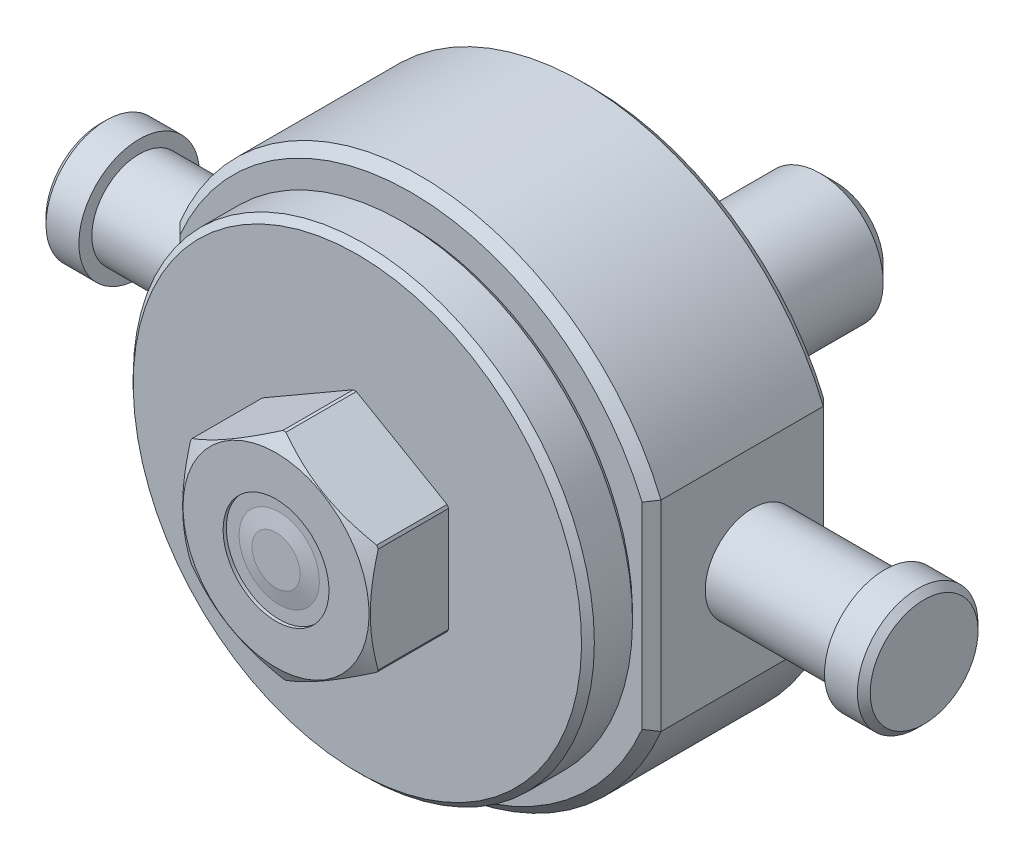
ISO-10303-21;
HEADER;
FILE_DESCRIPTION(('STEP AP214'),'2;1');
FILE_NAME('part.step','',(''),(''),'','','');
FILE_SCHEMA(('AUTOMOTIVE_DESIGN { 1 0 10303 214 1 1 1 1 }'));
ENDSEC;
DATA;
#1=APPLICATION_CONTEXT('core data for automotive mechanical design processes');
#2=APPLICATION_PROTOCOL_DEFINITION('international standard','automotive_design',2000,#1);
#3=PRODUCT_CONTEXT('',#1,'mechanical');
#4=PRODUCT('Part','Part','',(#3));
#5=PRODUCT_RELATED_PRODUCT_CATEGORY('part','',(#4));
#6=PRODUCT_DEFINITION_FORMATION('','',#4);
#7=PRODUCT_DEFINITION_CONTEXT('part definition',#1,'design');
#8=PRODUCT_DEFINITION('design','',#6,#7);
#9=PRODUCT_DEFINITION_SHAPE('','',#8);
#10=(LENGTH_UNIT() NAMED_UNIT(*) SI_UNIT(.MILLI.,.METRE.));
#11=(NAMED_UNIT(*) PLANE_ANGLE_UNIT() SI_UNIT($,.RADIAN.));
#12=(NAMED_UNIT(*) SI_UNIT($,.STERADIAN.) SOLID_ANGLE_UNIT());
#13=UNCERTAINTY_MEASURE_WITH_UNIT(LENGTH_MEASURE(1.E-05),#10,'distance_accuracy_value','');
#14=(GEOMETRIC_REPRESENTATION_CONTEXT(3) GLOBAL_UNCERTAINTY_ASSIGNED_CONTEXT((#13)) GLOBAL_UNIT_ASSIGNED_CONTEXT((#10,
#11,#12)) REPRESENTATION_CONTEXT('',''));
#15=CARTESIAN_POINT('',(0.,0.,0.));
#16=DIRECTION('',(0.,0.,1.));
#17=DIRECTION('',(1.,0.,0.));
#18=AXIS2_PLACEMENT_3D('',#15,#16,#17);
#19=CARTESIAN_POINT('',(-38.1,38.3191756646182,20.));
#20=DIRECTION('',(-1.,0.,0.));
#21=DIRECTION('',(0.,-1.,0.));
#22=AXIS2_PLACEMENT_3D('',#19,#20,#21);
#23=PLANE('',#22);
#24=DIRECTION('',(0.,0.,-1.));
#25=VECTOR('',#24,1.);
#26=CARTESIAN_POINT('',(-38.1,15.875,35.2806));
#27=LINE('',#26,#25);
#28=CARTESIAN_POINT('',(-38.1,15.875,8.0786));
#29=VERTEX_POINT('',#28);
#30=CARTESIAN_POINT('',(-38.1,15.875,33.7806));
#31=VERTEX_POINT('',#30);
#32=EDGE_CURVE('E530',#29,#31,#27,.F.);
#33=ORIENTED_EDGE('',*,*,#32,.F.);
#34=DIRECTION('',(0.,-1.,0.));
#35=VECTOR('',#34,1.);
#36=CARTESIAN_POINT('',(-38.1,-11.4210605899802,8.0786));
#37=LINE('',#36,#35);
#38=CARTESIAN_POINT('',(-38.1,-15.875,8.0786));
#39=VERTEX_POINT('',#38);
#40=EDGE_CURVE('E1060',#29,#39,#37,.T.);
#41=ORIENTED_EDGE('',*,*,#40,.T.);
#42=DIRECTION('',(0.,0.,-1.));
#43=VECTOR('',#42,1.);
#44=CARTESIAN_POINT('',(-38.1,-15.875,35.2806));
#45=LINE('',#44,#43);
#46=CARTESIAN_POINT('',(-38.1,-15.875,33.7806));
#47=VERTEX_POINT('',#46);
#48=EDGE_CURVE('E179',#47,#39,#45,.T.);
#49=ORIENTED_EDGE('',*,*,#48,.F.);
#50=DIRECTION('',(0.,1.,0.));
#51=VECTOR('',#50,1.);
#52=CARTESIAN_POINT('',(-38.1,38.3191756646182,33.7806));
#53=LINE('',#52,#51);
#54=EDGE_CURVE('E1058',#47,#31,#53,.T.);
#55=ORIENTED_EDGE('',*,*,#54,.T.);
#56=EDGE_LOOP('',(#33,#41,#49,#55));
#57=FACE_BOUND('',#56,.T.);
#58=CARTESIAN_POINT('',(-38.1,0.,19.2786));
#59=DIRECTION('',(-1.,0.,0.));
#60=DIRECTION('',(0.,-1.,0.));
#61=AXIS2_PLACEMENT_3D('',#58,#59,#60);
#62=CIRCLE('',#61,7.5);
#63=CARTESIAN_POINT('',(-38.1,-7.50000000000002,19.2786));
#64=VERTEX_POINT('',#63);
#65=EDGE_CURVE('E519',#64,#64,#62,.F.);
#66=ORIENTED_EDGE('',*,*,#65,.T.);
#67=EDGE_LOOP('',(#66));
#68=FACE_BOUND('',#67,.T.);
#69=ADVANCED_FACE('F14',(#57,#68),#23,.T.);
#70=CARTESIAN_POINT('',(38.1,38.3191756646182,20.));
#71=DIRECTION('',(1.,0.,0.));
#72=DIRECTION('',(0.,1.,0.));
#73=AXIS2_PLACEMENT_3D('',#70,#71,#72);
#74=PLANE('',#73);
#75=DIRECTION('',(0.,0.,-1.));
#76=VECTOR('',#75,1.);
#77=CARTESIAN_POINT('',(38.1,15.875,35.2806));
#78=LINE('',#77,#76);
#79=CARTESIAN_POINT('',(38.1,15.875,33.7806));
#80=VERTEX_POINT('',#79);
#81=CARTESIAN_POINT('',(38.1,15.875,8.0786));
#82=VERTEX_POINT('',#81);
#83=EDGE_CURVE('E168',#80,#82,#78,.T.);
#84=ORIENTED_EDGE('',*,*,#83,.F.);
#85=DIRECTION('',(0.,-1.,0.));
#86=VECTOR('',#85,1.);
#87=CARTESIAN_POINT('',(38.1,38.3191756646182,33.7806));
#88=LINE('',#87,#86);
#89=CARTESIAN_POINT('',(38.1,-15.875,33.7806));
#90=VERTEX_POINT('',#89);
#91=EDGE_CURVE('E9',#80,#90,#88,.T.);
#92=ORIENTED_EDGE('',*,*,#91,.T.);
#93=DIRECTION('',(0.,0.,-1.));
#94=VECTOR('',#93,1.);
#95=CARTESIAN_POINT('',(38.1,-15.875,35.2806));
#96=LINE('',#95,#94);
#97=CARTESIAN_POINT('',(38.1,-15.875,8.0786));
#98=VERTEX_POINT('',#97);
#99=EDGE_CURVE('E165',#98,#90,#96,.F.);
#100=ORIENTED_EDGE('',*,*,#99,.F.);
#101=DIRECTION('',(0.,1.,0.));
#102=VECTOR('',#101,1.);
#103=CARTESIAN_POINT('',(38.1,11.4210605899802,8.0786));
#104=LINE('',#103,#102);
#105=EDGE_CURVE('E23',#98,#82,#104,.T.);
#106=ORIENTED_EDGE('',*,*,#105,.T.);
#107=EDGE_LOOP('',(#84,#92,#100,#106));
#108=FACE_BOUND('',#107,.T.);
#109=CARTESIAN_POINT('',(38.1,0.,19.2786));
#110=DIRECTION('',(1.,0.,0.));
#111=DIRECTION('',(0.,1.,0.));
#112=AXIS2_PLACEMENT_3D('',#109,#110,#111);
#113=CIRCLE('',#112,7.5);
#114=CARTESIAN_POINT('',(38.1,7.49999999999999,19.2786));
#115=VERTEX_POINT('',#114);
#116=EDGE_CURVE('E536',#115,#115,#113,.F.);
#117=ORIENTED_EDGE('',*,*,#116,.T.);
#118=EDGE_LOOP('',(#117));
#119=FACE_BOUND('',#118,.T.);
#120=ADVANCED_FACE('F162',(#108,#119),#74,.T.);
#121=CARTESIAN_POINT('',(0.,0.,35.2806));
#122=DIRECTION('',(0.,0.,-1.));
#123=DIRECTION('',(0.,1.,0.));
#124=AXIS2_PLACEMENT_3D('',#121,#122,#123);
#125=CYLINDRICAL_SURFACE('',#124,41.275);
#126=CARTESIAN_POINT('',(0.,0.,33.7806));
#127=DIRECTION('',(0.,0.,1.));
#128=DIRECTION('',(1.,0.,0.));
#129=AXIS2_PLACEMENT_3D('',#126,#127,#128);
#130=CIRCLE('',#129,41.275);
#131=EDGE_CURVE('E185',#80,#31,#130,.T.);
#132=ORIENTED_EDGE('',*,*,#131,.F.);
#133=ORIENTED_EDGE('',*,*,#83,.T.);
#134=CARTESIAN_POINT('',(0.,0.,8.0786));
#135=DIRECTION('',(0.,0.,1.));
#136=DIRECTION('',(1.,0.,0.));
#137=AXIS2_PLACEMENT_3D('',#134,#135,#136);
#138=CIRCLE('',#137,41.275);
#139=EDGE_CURVE('E518',#82,#29,#138,.T.);
#140=ORIENTED_EDGE('',*,*,#139,.T.);
#141=ORIENTED_EDGE('',*,*,#32,.T.);
#142=EDGE_LOOP('',(#132,#133,#140,#141));
#143=FACE_BOUND('',#142,.T.);
#144=ADVANCED_FACE('F437',(#143),#125,.T.);
#145=CARTESIAN_POINT('',(0.,0.,33.7806));
#146=DIRECTION('',(0.,0.,-1.));
#147=DIRECTION('',(-1.,0.,0.));
#148=AXIS2_PLACEMENT_3D('',#145,#146,#147);
#149=CONICAL_SURFACE('',#148,41.275,0.785398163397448);
#150=CARTESIAN_POINT('',(0.,0.,35.2806));
#151=DIRECTION('',(0.,0.,1.));
#152=DIRECTION('',(1.,0.,0.));
#153=AXIS2_PLACEMENT_3D('',#150,#151,#152);
#154=CIRCLE('',#153,39.775);
#155=CARTESIAN_POINT('',(-36.6,-15.5721104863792,35.2806));
#156=VERTEX_POINT('',#155);
#157=CARTESIAN_POINT('',(36.6,-15.5721104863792,35.2806));
#158=VERTEX_POINT('',#157);
#159=EDGE_CURVE('E187',#156,#158,#154,.T.);
#160=ORIENTED_EDGE('',*,*,#159,.F.);
#161=CARTESIAN_POINT('',(-36.6,-15.5721104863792,35.2806));
#162=CARTESIAN_POINT('',(-36.8499518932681,-15.6230685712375,35.0306481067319));
#163=CARTESIAN_POINT('',(-37.0999278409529,-15.6737884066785,34.7806721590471));
#164=CARTESIAN_POINT('',(-37.5999278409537,-15.7747515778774,34.2806721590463));
#165=CARTESIAN_POINT('',(-37.8499518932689,-15.8249949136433,34.0306481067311));
#166=CARTESIAN_POINT('',(-38.1,-15.875,33.7806));
#167=B_SPLINE_CURVE_WITH_KNOTS('',3,(#161,#162,#163,#164,#165,#166),.UNSPECIFIED.,.F.,.F.,(4,2,
4),(0.,1.0714177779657,2.14283553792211),.UNSPECIFIED.);
#168=EDGE_CURVE('E156',#156,#47,#167,.T.);
#169=ORIENTED_EDGE('',*,*,#168,.T.);
#170=EDGE_CURVE('E174',#47,#90,#130,.T.);
#171=ORIENTED_EDGE('',*,*,#170,.T.);
#172=CARTESIAN_POINT('',(38.1,-15.875,33.7806));
#173=CARTESIAN_POINT('',(37.8499518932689,-15.8249949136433,34.0306481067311));
#174=CARTESIAN_POINT('',(37.5999278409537,-15.7747515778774,34.2806721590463));
#175=CARTESIAN_POINT('',(37.0999278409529,-15.6737884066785,34.7806721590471));
#176=CARTESIAN_POINT('',(36.8499518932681,-15.6230685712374,35.0306481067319));
#177=CARTESIAN_POINT('',(36.6,-15.5721104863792,35.2806));
#178=B_SPLINE_CURVE_WITH_KNOTS('',3,(#172,#173,#174,#175,#176,#177),.UNSPECIFIED.,.F.,.F.,(4,2,
4),(0.,1.0714177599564,2.14283553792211),.UNSPECIFIED.);
#179=EDGE_CURVE('E30',#90,#158,#178,.T.);
#180=ORIENTED_EDGE('',*,*,#179,.T.);
#181=EDGE_LOOP('',(#160,#169,#171,#180));
#182=FACE_BOUND('',#181,.T.);
#183=ADVANCED_FACE('F181',(#182),#149,.T.);
#184=CARTESIAN_POINT('',(-86.4658034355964,0.,19.2786));
#185=DIRECTION('',(1.,0.,0.));
#186=DIRECTION('',(0.,1.,0.));
#187=AXIS2_PLACEMENT_3D('',#184,#185,#186);
#188=CYLINDRICAL_SURFACE('',#187,7.5);
#189=ORIENTED_EDGE('',*,*,#65,.F.);
#190=EDGE_LOOP('',(#189));
#191=FACE_BOUND('',#190,.T.);
#192=CARTESIAN_POINT('',(-59.0296,0.,19.2786));
#193=DIRECTION('',(1.,0.,0.));
#194=DIRECTION('',(0.,1.,0.));
#195=AXIS2_PLACEMENT_3D('',#192,#193,#194);
#196=CIRCLE('',#195,7.5);
#197=CARTESIAN_POINT('',(-59.0296,7.5,19.2786));
#198=VERTEX_POINT('',#197);
#199=EDGE_CURVE('E199',#198,#198,#196,.T.);
#200=ORIENTED_EDGE('',*,*,#199,.T.);
#201=EDGE_LOOP('',(#200));
#202=FACE_BOUND('',#201,.T.);
#203=ADVANCED_FACE('F447',(#191,#202),#188,.T.);
#204=CARTESIAN_POINT('',(0.,0.,6.5786));
#205=DIRECTION('',(0.,0.,1.));
#206=DIRECTION('',(1.,0.,0.));
#207=AXIS2_PLACEMENT_3D('',#204,#205,#206);
#208=CONICAL_SURFACE('',#207,39.775,0.785398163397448);
#209=EDGE_CURVE('E177',#39,#98,#138,.T.);
#210=ORIENTED_EDGE('',*,*,#209,.F.);
#211=CARTESIAN_POINT('',(-38.1,-15.875,8.0786));
#212=CARTESIAN_POINT('',(-37.8499518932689,-15.8249949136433,7.82855189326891));
#213=CARTESIAN_POINT('',(-37.5999278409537,-15.7747515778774,7.57852784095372));
#214=CARTESIAN_POINT('',(-37.0999278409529,-15.6737884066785,7.07852784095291));
#215=CARTESIAN_POINT('',(-36.8499518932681,-15.6230685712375,6.8285518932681));
#216=CARTESIAN_POINT('',(-36.6,-15.5721104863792,6.5786));
#217=B_SPLINE_CURVE_WITH_KNOTS('',3,(#211,#212,#213,#214,#215,#216),.UNSPECIFIED.,.F.,.F.,(4,2,
4),(0.,1.0714177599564,2.1428355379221),.UNSPECIFIED.);
#218=CARTESIAN_POINT('',(-36.6,-15.5721104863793,6.5786));
#219=VERTEX_POINT('',#218);
#220=EDGE_CURVE('E471',#39,#219,#217,.T.);
#221=ORIENTED_EDGE('',*,*,#220,.T.);
#222=CARTESIAN_POINT('',(0.,0.,6.5786));
#223=DIRECTION('',(0.,0.,1.));
#224=DIRECTION('',(1.,0.,0.));
#225=AXIS2_PLACEMENT_3D('',#222,#223,#224);
#226=CIRCLE('',#225,39.775);
#227=CARTESIAN_POINT('',(36.6,-15.5721104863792,6.5786));
#228=VERTEX_POINT('',#227);
#229=EDGE_CURVE('E526',#219,#228,#226,.T.);
#230=ORIENTED_EDGE('',*,*,#229,.T.);
#231=CARTESIAN_POINT('',(36.6,-15.5721104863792,6.5786));
#232=CARTESIAN_POINT('',(36.8499518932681,-15.6230685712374,6.8285518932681));
#233=CARTESIAN_POINT('',(37.0999278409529,-15.6737884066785,7.0785278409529));
#234=CARTESIAN_POINT('',(37.5999278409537,-15.7747515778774,7.57852784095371));
#235=CARTESIAN_POINT('',(37.8499518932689,-15.8249949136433,7.82855189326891));
#236=CARTESIAN_POINT('',(38.1,-15.875,8.0786));
#237=B_SPLINE_CURVE_WITH_KNOTS('',3,(#231,#232,#233,#234,#235,#236),.UNSPECIFIED.,.F.,.F.,(4,2,
4),(0.,1.07141777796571,2.14283553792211),.UNSPECIFIED.);
#238=EDGE_CURVE('E464',#228,#98,#237,.T.);
#239=ORIENTED_EDGE('',*,*,#238,.T.);
#240=EDGE_LOOP('',(#210,#221,#230,#239));
#241=FACE_BOUND('',#240,.T.);
#242=ADVANCED_FACE('F442',(#241),#208,.T.);
#243=CARTESIAN_POINT('',(36.6,15.5721104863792,6.5786));
#244=VERTEX_POINT('',#243);
#245=CARTESIAN_POINT('',(-36.6,15.5721104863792,6.5786));
#246=VERTEX_POINT('',#245);
#247=EDGE_CURVE('E528',#244,#246,#226,.T.);
#248=ORIENTED_EDGE('',*,*,#247,.T.);
#249=CARTESIAN_POINT('',(-36.6,15.5721104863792,6.5786));
#250=CARTESIAN_POINT('',(-36.8499518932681,15.6230685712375,6.8285518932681));
#251=CARTESIAN_POINT('',(-37.0999278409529,15.6737884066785,7.07852784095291));
#252=CARTESIAN_POINT('',(-37.5999278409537,15.7747515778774,7.57852784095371));
#253=CARTESIAN_POINT('',(-37.8499518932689,15.8249949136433,7.82855189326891));
#254=CARTESIAN_POINT('',(-38.1,15.875,8.0786));
#255=B_SPLINE_CURVE_WITH_KNOTS('',3,(#249,#250,#251,#252,#253,#254),.UNSPECIFIED.,.F.,.F.,(4,2,
4),(0.,1.0714177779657,2.1428355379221),.UNSPECIFIED.);
#256=EDGE_CURVE('E454',#246,#29,#255,.T.);
#257=ORIENTED_EDGE('',*,*,#256,.T.);
#258=ORIENTED_EDGE('',*,*,#139,.F.);
#259=CARTESIAN_POINT('',(38.1,15.875,8.0786));
#260=CARTESIAN_POINT('',(37.8499518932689,15.8249949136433,7.82855189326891));
#261=CARTESIAN_POINT('',(37.5999278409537,15.7747515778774,7.57852784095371));
#262=CARTESIAN_POINT('',(37.0999278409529,15.6737884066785,7.0785278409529));
#263=CARTESIAN_POINT('',(36.8499518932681,15.6230685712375,6.8285518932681));
#264=CARTESIAN_POINT('',(36.6,15.5721104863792,6.5786));
#265=B_SPLINE_CURVE_WITH_KNOTS('',3,(#259,#260,#261,#262,#263,#264),.UNSPECIFIED.,.F.,.F.,(4,2,
4),(0.,1.0714177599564,2.14283553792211),.UNSPECIFIED.);
#266=EDGE_CURVE('E523',#82,#244,#265,.T.);
#267=ORIENTED_EDGE('',*,*,#266,.T.);
#268=EDGE_LOOP('',(#248,#257,#258,#267));
#269=FACE_BOUND('',#268,.T.);
#270=ADVANCED_FACE('F446',(#269),#208,.T.);
#271=ORIENTED_EDGE('',*,*,#99,.T.);
#272=ORIENTED_EDGE('',*,*,#170,.F.);
#273=ORIENTED_EDGE('',*,*,#48,.T.);
#274=ORIENTED_EDGE('',*,*,#209,.T.);
#275=EDGE_LOOP('',(#271,#272,#273,#274));
#276=FACE_BOUND('',#275,.T.);
#277=ADVANCED_FACE('F172',(#276),#125,.T.);
#278=CARTESIAN_POINT('',(0.,0.,6.5786));
#279=DIRECTION('',(0.,0.,1.));
#280=DIRECTION('',(0.,-1.,0.));
#281=AXIS2_PLACEMENT_3D('',#278,#279,#280);
#282=PLANE('',#281);
#283=CARTESIAN_POINT('',(0.,0.,6.5786));
#284=DIRECTION('',(0.,0.,-1.));
#285=DIRECTION('',(0.,1.,0.));
#286=AXIS2_PLACEMENT_3D('',#283,#284,#285);
#287=CIRCLE('',#286,28.702);
#288=CARTESIAN_POINT('',(0.,28.702,6.5786));
#289=VERTEX_POINT('',#288);
#290=EDGE_CURVE('E207',#289,#289,#287,.T.);
#291=ORIENTED_EDGE('',*,*,#290,.F.);
#292=EDGE_LOOP('',(#291));
#293=FACE_BOUND('',#292,.T.);
#294=ORIENTED_EDGE('',*,*,#229,.F.);
#295=DIRECTION('',(0.,1.,0.));
#296=VECTOR('',#295,1.);
#297=CARTESIAN_POINT('',(-36.6,11.4210605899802,6.5786));
#298=LINE('',#297,#296);
#299=EDGE_CURVE('E1065',#219,#246,#298,.T.);
#300=ORIENTED_EDGE('',*,*,#299,.T.);
#301=ORIENTED_EDGE('',*,*,#247,.F.);
#302=DIRECTION('',(0.,-1.,0.));
#303=VECTOR('',#302,1.);
#304=CARTESIAN_POINT('',(36.6,-11.4210605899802,6.5786));
#305=LINE('',#304,#303);
#306=EDGE_CURVE('E477',#244,#228,#305,.T.);
#307=ORIENTED_EDGE('',*,*,#306,.T.);
#308=EDGE_LOOP('',(#294,#300,#301,#307));
#309=FACE_BOUND('',#308,.T.);
#310=ADVANCED_FACE('F544',(#293,#309),#282,.F.);
#311=ORIENTED_EDGE('',*,*,#116,.F.);
#312=EDGE_LOOP('',(#311));
#313=FACE_BOUND('',#312,.T.);
#314=CARTESIAN_POINT('',(59.0296,0.,19.2786));
#315=DIRECTION('',(-1.,0.,0.));
#316=DIRECTION('',(0.,-1.,0.));
#317=AXIS2_PLACEMENT_3D('',#314,#315,#316);
#318=CIRCLE('',#317,7.5);
#319=CARTESIAN_POINT('',(59.0296,-7.5,19.2786));
#320=VERTEX_POINT('',#319);
#321=EDGE_CURVE('E196',#320,#320,#318,.T.);
#322=ORIENTED_EDGE('',*,*,#321,.T.);
#323=EDGE_LOOP('',(#322));
#324=FACE_BOUND('',#323,.T.);
#325=ADVANCED_FACE('F540',(#313,#324),#188,.T.);
#326=CARTESIAN_POINT('',(0.,-14.732,56.642));
#327=DIRECTION('',(0.,0.,1.));
#328=DIRECTION('',(0.,-1.,0.));
#329=AXIS2_PLACEMENT_3D('',#326,#327,#328);
#330=PLANE('',#329);
#331=CARTESIAN_POINT('',(0.,0.,56.6420000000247));
#332=DIRECTION('',(0.,0.,-1.));
#333=DIRECTION('',(0.,1.,0.));
#334=AXIS2_PLACEMENT_3D('',#331,#332,#333);
#335=CIRCLE('',#334,3.80999999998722);
#336=CARTESIAN_POINT('',(0.,3.80999999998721,56.6420000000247));
#337=VERTEX_POINT('',#336);
#338=EDGE_CURVE('E202',#337,#337,#335,.T.);
#339=ORIENTED_EDGE('',*,*,#338,.F.);
#340=EDGE_LOOP('',(#339));
#341=FACE_BOUND('',#340,.T.);
#342=ADVANCED_FACE('F543',(#341),#330,.T.);
#343=CARTESIAN_POINT('',(0.,0.,56.1340000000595));
#344=DIRECTION('',(0.,0.,-1.));
#345=DIRECTION('',(0.,1.,0.));
#346=AXIS2_PLACEMENT_3D('',#343,#344,#345);
#347=CONICAL_SURFACE('',#346,6.34999999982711,1.37340076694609);
#348=ORIENTED_EDGE('',*,*,#338,.T.);
#349=EDGE_LOOP('',(#348));
#350=FACE_BOUND('',#349,.T.);
#351=CARTESIAN_POINT('',(0.,0.,56.1340000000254));
#352=DIRECTION('',(0.,0.,-1.));
#353=DIRECTION('',(0.,1.,0.));
#354=AXIS2_PLACEMENT_3D('',#351,#352,#353);
#355=CIRCLE('',#354,6.34999999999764);
#356=CARTESIAN_POINT('',(0.,6.34999999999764,56.1340000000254));
#357=VERTEX_POINT('',#356);
#358=EDGE_CURVE('E1048',#357,#357,#355,.T.);
#359=ORIENTED_EDGE('',*,*,#358,.F.);
#360=EDGE_LOOP('',(#359));
#361=FACE_BOUND('',#360,.T.);
#362=ADVANCED_FACE('F828',(#350,#361),#347,.T.);
#363=CARTESIAN_POINT('',(6.35,0.,56.134));
#364=DIRECTION('',(0.,0.,1.));
#365=DIRECTION('',(0.,-1.,0.));
#366=AXIS2_PLACEMENT_3D('',#363,#364,#365);
#367=PLANE('',#366);
#368=CARTESIAN_POINT('',(0.,0.,56.134));
#369=DIRECTION('',(0.,0.,-1.));
#370=DIRECTION('',(0.,1.,0.));
#371=AXIS2_PLACEMENT_3D('',#368,#369,#370);
#372=CIRCLE('',#371,8.382);
#373=CARTESIAN_POINT('',(0.,8.382,56.134));
#374=VERTEX_POINT('',#373);
#375=EDGE_CURVE('E1045',#374,#374,#372,.F.);
#376=ORIENTED_EDGE('',*,*,#375,.T.);
#377=EDGE_LOOP('',(#376));
#378=FACE_BOUND('',#377,.T.);
#379=ORIENTED_EDGE('',*,*,#358,.T.);
#380=EDGE_LOOP('',(#379));
#381=FACE_BOUND('',#380,.T.);
#382=ADVANCED_FACE('F834',(#378,#381),#367,.T.);
#383=CARTESIAN_POINT('',(0.,0.,4.953));
#384=DIRECTION('',(0.,0.,-1.));
#385=DIRECTION('',(0.,1.,0.));
#386=AXIS2_PLACEMENT_3D('',#383,#384,#385);
#387=CYLINDRICAL_SURFACE('',#386,8.382);
#388=ORIENTED_EDGE('',*,*,#375,.F.);
#389=EDGE_LOOP('',(#388));
#390=FACE_BOUND('',#389,.T.);
#391=CARTESIAN_POINT('',(0.,0.,56.642));
#392=DIRECTION('',(0.,0.,-1.));
#393=DIRECTION('',(0.,1.,0.));
#394=AXIS2_PLACEMENT_3D('',#391,#392,#393);
#395=CIRCLE('',#394,8.382);
#396=CARTESIAN_POINT('',(0.,8.382,56.642));
#397=VERTEX_POINT('',#396);
#398=EDGE_CURVE('E1031',#397,#397,#395,.T.);
#399=ORIENTED_EDGE('',*,*,#398,.F.);
#400=EDGE_LOOP('',(#399));
#401=FACE_BOUND('',#400,.T.);
#402=ADVANCED_FACE('F839',(#390,#401),#387,.F.);
#403=CARTESIAN_POINT('',(0.,-14.732,56.642));
#404=DIRECTION('',(0.,0.,1.));
#405=DIRECTION('',(0.,-1.,0.));
#406=AXIS2_PLACEMENT_3D('',#403,#404,#405);
#407=PLANE('',#406);
#408=ORIENTED_EDGE('',*,*,#398,.T.);
#409=EDGE_LOOP('',(#408));
#410=FACE_BOUND('',#409,.T.);
#411=CARTESIAN_POINT('',(0.,0.,56.642));
#412=DIRECTION('',(0.,0.,-1.));
#413=DIRECTION('',(0.,1.,0.));
#414=AXIS2_PLACEMENT_3D('',#411,#412,#413);
#415=CIRCLE('',#414,14.732);
#416=CARTESIAN_POINT('',(0.,14.732,56.642));
#417=VERTEX_POINT('',#416);
#418=EDGE_CURVE('E305',#417,#417,#415,.T.);
#419=ORIENTED_EDGE('',*,*,#418,.F.);
#420=EDGE_LOOP('',(#419));
#421=FACE_BOUND('',#420,.T.);
#422=ADVANCED_FACE('F855',(#410,#421),#407,.T.);
#423=CARTESIAN_POINT('',(0.,0.,-31.242));
#424=DIRECTION('',(0.,0.,1.));
#425=DIRECTION('',(0.,-1.,0.));
#426=AXIS2_PLACEMENT_3D('',#423,#424,#425);
#427=CYLINDRICAL_SURFACE('',#426,17.018);
#428=CARTESIAN_POINT('',(0.,0.,55.3221772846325));
#429=DIRECTION('',(0.,0.,-1.));
#430=DIRECTION('',(0.,1.,0.));
#431=AXIS2_PLACEMENT_3D('',#428,#429,#430);
#432=CIRCLE('',#431,17.018);
#433=CARTESIAN_POINT('',(-14.6139855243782,8.72030682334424,55.3221772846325));
#434=VERTEX_POINT('',#433);
#435=CARTESIAN_POINT('',(-14.859,8.29592930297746,55.3221772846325));
#436=VERTEX_POINT('',#435);
#437=EDGE_CURVE('E293',#434,#436,#432,.F.);
#438=ORIENTED_EDGE('',*,*,#437,.F.);
#439=DIRECTION('',(0.,0.,1.));
#440=VECTOR('',#439,1.);
#441=CARTESIAN_POINT('',(-14.6139855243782,8.72030682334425,-31.242));
#442=LINE('',#441,#440);
#443=CARTESIAN_POINT('',(-14.6139855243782,8.72030682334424,44.1706));
#444=VERTEX_POINT('',#443);
#445=EDGE_CURVE('E278',#444,#434,#442,.T.);
#446=ORIENTED_EDGE('',*,*,#445,.F.);
#447=CARTESIAN_POINT('',(0.,0.,44.1706));
#448=DIRECTION('',(0.,0.,1.));
#449=DIRECTION('',(0.,-1.,0.));
#450=AXIS2_PLACEMENT_3D('',#447,#448,#449);
#451=CIRCLE('',#450,17.018);
#452=CARTESIAN_POINT('',(-14.859,8.29592930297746,44.1706));
#453=VERTEX_POINT('',#452);
#454=EDGE_CURVE('E1042',#444,#453,#451,.T.);
#455=ORIENTED_EDGE('',*,*,#454,.T.);
#456=DIRECTION('',(0.,0.,1.));
#457=VECTOR('',#456,1.);
#458=CARTESIAN_POINT('',(-14.859,8.29592930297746,-31.242));
#459=LINE('',#458,#457);
#460=EDGE_CURVE('E281',#436,#453,#459,.F.);
#461=ORIENTED_EDGE('',*,*,#460,.F.);
#462=EDGE_LOOP('',(#438,#446,#455,#461));
#463=FACE_BOUND('',#462,.T.);
#464=ADVANCED_FACE('F861',(#463),#427,.T.);
#465=CARTESIAN_POINT('',(0.,0.,-31.242));
#466=DIRECTION('',(0.,0.,1.));
#467=DIRECTION('',(0.,-1.,0.));
#468=AXIS2_PLACEMENT_3D('',#465,#466,#467);
#469=CYLINDRICAL_SURFACE('',#468,17.018);
#470=CARTESIAN_POINT('',(0.,0.,55.3221772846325));
#471=DIRECTION('',(0.,0.,-1.));
#472=DIRECTION('',(0.,1.,0.));
#473=AXIS2_PLACEMENT_3D('',#470,#471,#472);
#474=CIRCLE('',#473,17.018);
#475=CARTESIAN_POINT('',(0.245014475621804,17.0162361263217,55.3221772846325));
#476=VERTEX_POINT('',#475);
#477=CARTESIAN_POINT('',(-0.245014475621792,17.0162361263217,55.3221772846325));
#478=VERTEX_POINT('',#477);
#479=EDGE_CURVE('E303',#476,#478,#474,.F.);
#480=ORIENTED_EDGE('',*,*,#479,.F.);
#481=DIRECTION('',(0.,0.,1.));
#482=VECTOR('',#481,1.);
#483=CARTESIAN_POINT('',(0.245014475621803,17.0162361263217,-31.242));
#484=LINE('',#483,#482);
#485=CARTESIAN_POINT('',(0.245014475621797,17.0162361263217,44.1706));
#486=VERTEX_POINT('',#485);
#487=EDGE_CURVE('E271',#486,#476,#484,.T.);
#488=ORIENTED_EDGE('',*,*,#487,.F.);
#489=CARTESIAN_POINT('',(0.,0.,44.1706));
#490=DIRECTION('',(0.,0.,1.));
#491=DIRECTION('',(0.,-1.,0.));
#492=AXIS2_PLACEMENT_3D('',#489,#490,#491);
#493=CIRCLE('',#492,17.018);
#494=CARTESIAN_POINT('',(-0.245014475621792,17.0162361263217,44.1706));
#495=VERTEX_POINT('',#494);
#496=EDGE_CURVE('E1040',#486,#495,#493,.T.);
#497=ORIENTED_EDGE('',*,*,#496,.T.);
#498=DIRECTION('',(0.,0.,1.));
#499=VECTOR('',#498,1.);
#500=CARTESIAN_POINT('',(-0.245014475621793,17.0162361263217,-31.242));
#501=LINE('',#500,#499);
#502=EDGE_CURVE('E274',#478,#495,#501,.F.);
#503=ORIENTED_EDGE('',*,*,#502,.F.);
#504=EDGE_LOOP('',(#480,#488,#497,#503));
#505=FACE_BOUND('',#504,.T.);
#506=ADVANCED_FACE('F866',(#505),#469,.T.);
#507=CARTESIAN_POINT('',(0.,0.,-31.242));
#508=DIRECTION('',(0.,0.,1.));
#509=DIRECTION('',(0.,-1.,0.));
#510=AXIS2_PLACEMENT_3D('',#507,#508,#509);
#511=CYLINDRICAL_SURFACE('',#510,17.018);
#512=CARTESIAN_POINT('',(0.,0.,55.3221772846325));
#513=DIRECTION('',(0.,0.,-1.));
#514=DIRECTION('',(0.,1.,0.));
#515=AXIS2_PLACEMENT_3D('',#512,#513,#514);
#516=CIRCLE('',#515,17.018);
#517=CARTESIAN_POINT('',(14.859,8.29592930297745,55.3221772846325));
#518=VERTEX_POINT('',#517);
#519=CARTESIAN_POINT('',(14.6139855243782,8.72030682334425,55.3221772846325));
#520=VERTEX_POINT('',#519);
#521=EDGE_CURVE('E298',#518,#520,#516,.F.);
#522=ORIENTED_EDGE('',*,*,#521,.F.);
#523=DIRECTION('',(0.,0.,1.));
#524=VECTOR('',#523,1.);
#525=CARTESIAN_POINT('',(14.859,8.29592930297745,-31.242));
#526=LINE('',#525,#524);
#527=CARTESIAN_POINT('',(14.859,8.29592930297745,44.1706));
#528=VERTEX_POINT('',#527);
#529=EDGE_CURVE('E264',#528,#518,#526,.T.);
#530=ORIENTED_EDGE('',*,*,#529,.F.);
#531=CARTESIAN_POINT('',(0.,0.,44.1706));
#532=DIRECTION('',(0.,0.,1.));
#533=DIRECTION('',(0.,-1.,0.));
#534=AXIS2_PLACEMENT_3D('',#531,#532,#533);
#535=CIRCLE('',#534,17.018);
#536=CARTESIAN_POINT('',(14.6139855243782,8.72030682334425,44.1706));
#537=VERTEX_POINT('',#536);
#538=EDGE_CURVE('E1038',#528,#537,#535,.T.);
#539=ORIENTED_EDGE('',*,*,#538,.T.);
#540=DIRECTION('',(0.,0.,1.));
#541=VECTOR('',#540,1.);
#542=CARTESIAN_POINT('',(14.6139855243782,8.72030682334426,-31.242));
#543=LINE('',#542,#541);
#544=EDGE_CURVE('E267',#520,#537,#543,.F.);
#545=ORIENTED_EDGE('',*,*,#544,.F.);
#546=EDGE_LOOP('',(#522,#530,#539,#545));
#547=FACE_BOUND('',#546,.T.);
#548=ADVANCED_FACE('F875',(#547),#511,.T.);
#549=CARTESIAN_POINT('',(0.,0.,-31.242));
#550=DIRECTION('',(0.,0.,1.));
#551=DIRECTION('',(0.,-1.,0.));
#552=AXIS2_PLACEMENT_3D('',#549,#550,#551);
#553=CYLINDRICAL_SURFACE('',#552,17.018);
#554=CARTESIAN_POINT('',(0.,0.,55.3221772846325));
#555=DIRECTION('',(0.,0.,-1.));
#556=DIRECTION('',(0.,1.,0.));
#557=AXIS2_PLACEMENT_3D('',#554,#555,#556);
#558=CIRCLE('',#557,17.018);
#559=CARTESIAN_POINT('',(14.6139855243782,-8.72030682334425,55.3221772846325));
#560=VERTEX_POINT('',#559);
#561=CARTESIAN_POINT('',(14.859,-8.29592930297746,55.3221772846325));
#562=VERTEX_POINT('',#561);
#563=EDGE_CURVE('E296',#560,#562,#558,.F.);
#564=ORIENTED_EDGE('',*,*,#563,.F.);
#565=DIRECTION('',(0.,0.,1.));
#566=VECTOR('',#565,1.);
#567=CARTESIAN_POINT('',(14.6139855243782,-8.72030682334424,-31.242));
#568=LINE('',#567,#566);
#569=CARTESIAN_POINT('',(14.6139855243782,-8.72030682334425,44.1706));
#570=VERTEX_POINT('',#569);
#571=EDGE_CURVE('E257',#570,#560,#568,.T.);
#572=ORIENTED_EDGE('',*,*,#571,.F.);
#573=CARTESIAN_POINT('',(0.,0.,44.1706));
#574=DIRECTION('',(0.,0.,1.));
#575=DIRECTION('',(0.,-1.,0.));
#576=AXIS2_PLACEMENT_3D('',#573,#574,#575);
#577=CIRCLE('',#576,17.018);
#578=CARTESIAN_POINT('',(14.859,-8.29592930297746,44.1706));
#579=VERTEX_POINT('',#578);
#580=EDGE_CURVE('E299',#570,#579,#577,.T.);
#581=ORIENTED_EDGE('',*,*,#580,.T.);
#582=DIRECTION('',(0.,0.,1.));
#583=VECTOR('',#582,1.);
#584=CARTESIAN_POINT('',(14.859,-8.29592930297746,-31.242));
#585=LINE('',#584,#583);
#586=EDGE_CURVE('E260',#562,#579,#585,.F.);
#587=ORIENTED_EDGE('',*,*,#586,.F.);
#588=EDGE_LOOP('',(#564,#572,#581,#587));
#589=FACE_BOUND('',#588,.T.);
#590=ADVANCED_FACE('F884',(#589),#553,.T.);
#591=CARTESIAN_POINT('',(0.,0.,-31.242));
#592=DIRECTION('',(0.,0.,1.));
#593=DIRECTION('',(0.,-1.,0.));
#594=AXIS2_PLACEMENT_3D('',#591,#592,#593);
#595=CYLINDRICAL_SURFACE('',#594,17.018);
#596=CARTESIAN_POINT('',(0.,0.,55.3221772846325));
#597=DIRECTION('',(0.,0.,-1.));
#598=DIRECTION('',(0.,1.,0.));
#599=AXIS2_PLACEMENT_3D('',#596,#597,#598);
#600=CIRCLE('',#599,17.018);
#601=CARTESIAN_POINT('',(-0.245014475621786,-17.0162361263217,55.3221772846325));
#602=VERTEX_POINT('',#601);
#603=CARTESIAN_POINT('',(0.245014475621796,-17.0162361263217,55.3221772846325));
#604=VERTEX_POINT('',#603);
#605=EDGE_CURVE('E291',#602,#604,#600,.F.);
#606=ORIENTED_EDGE('',*,*,#605,.F.);
#607=DIRECTION('',(0.,0.,1.));
#608=VECTOR('',#607,1.);
#609=CARTESIAN_POINT('',(-0.245014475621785,-17.0162361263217,-31.242));
#610=LINE('',#609,#608);
#611=CARTESIAN_POINT('',(-0.245014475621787,-17.0162361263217,44.1706));
#612=VERTEX_POINT('',#611);
#613=EDGE_CURVE('E250',#612,#602,#610,.T.);
#614=ORIENTED_EDGE('',*,*,#613,.F.);
#615=CARTESIAN_POINT('',(0.,0.,44.1706));
#616=DIRECTION('',(0.,0.,1.));
#617=DIRECTION('',(0.,-1.,0.));
#618=AXIS2_PLACEMENT_3D('',#615,#616,#617);
#619=CIRCLE('',#618,17.018);
#620=CARTESIAN_POINT('',(0.245014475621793,-17.0162361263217,44.1706));
#621=VERTEX_POINT('',#620);
#622=EDGE_CURVE('E301',#612,#621,#619,.T.);
#623=ORIENTED_EDGE('',*,*,#622,.T.);
#624=DIRECTION('',(0.,0.,1.));
#625=VECTOR('',#624,1.);
#626=CARTESIAN_POINT('',(0.245014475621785,-17.0162361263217,-31.242));
#627=LINE('',#626,#625);
#628=EDGE_CURVE('E253',#604,#621,#627,.F.);
#629=ORIENTED_EDGE('',*,*,#628,.F.);
#630=EDGE_LOOP('',(#606,#614,#623,#629));
#631=FACE_BOUND('',#630,.T.);
#632=ADVANCED_FACE('F361',(#631),#595,.T.);
#633=CARTESIAN_POINT('',(0.,0.,55.3221772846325));
#634=DIRECTION('',(0.,0.,-1.));
#635=DIRECTION('',(0.,1.,0.));
#636=AXIS2_PLACEMENT_3D('',#633,#634,#635);
#637=CONICAL_SURFACE('',#636,17.018,1.0471975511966);
#638=ORIENTED_EDGE('',*,*,#418,.T.);
#639=EDGE_LOOP('',(#638));
#640=FACE_BOUND('',#639,.T.);
#641=CARTESIAN_POINT('',(-0.245014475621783,-17.0162361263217,55.3221772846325));
#642=CARTESIAN_POINT('',(-0.569572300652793,-16.8288525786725,55.4276475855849));
#643=CARTESIAN_POINT('',(-0.895393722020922,-16.6407394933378,55.5280937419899));
#644=CARTESIAN_POINT('',(-1.54962088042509,-16.263021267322,55.7175839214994));
#645=CARTESIAN_POINT('',(-1.87802742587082,-16.0734156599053,55.8066242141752));
#646=CARTESIAN_POINT('',(-2.53797671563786,-15.6923937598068,55.9720553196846));
#647=CARTESIAN_POINT('',(-2.86952467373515,-15.50097445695,56.0484186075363));
#648=CARTESIAN_POINT('',(-3.53483115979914,-15.1168595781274,56.1868444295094));
#649=CARTESIAN_POINT('',(-3.86858946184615,-14.9241641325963,56.2489084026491));
#650=CARTESIAN_POINT('',(-4.53002847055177,-14.5422821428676,56.3561412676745));
#651=CARTESIAN_POINT('',(-4.85766418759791,-14.3531215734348,56.4016779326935));
#652=CARTESIAN_POINT('',(-5.51431778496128,-13.9740024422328,56.4768651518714));
#653=CARTESIAN_POINT('',(-5.84333569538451,-13.7840438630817,56.5065153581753));
#654=CARTESIAN_POINT('',(-6.50181714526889,-13.4038694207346,56.5491843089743));
#655=CARTESIAN_POINT('',(-6.8312797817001,-13.2136540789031,56.5622215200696));
#656=CARTESIAN_POINT('',(-7.49037465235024,-12.8331254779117,56.5713922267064));
#657=CARTESIAN_POINT('',(-7.8200068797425,-12.6428122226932,56.5675263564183));
#658=CARTESIAN_POINT('',(-8.42016583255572,-12.29631028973,56.545181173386));
#659=CARTESIAN_POINT('',(-8.69077172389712,-12.1400759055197,56.529424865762));
#660=CARTESIAN_POINT('',(-9.23134405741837,-11.8279763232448,56.486833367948));
#661=CARTESIAN_POINT('',(-9.50131046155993,-11.6721111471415,56.4599975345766));
#662=CARTESIAN_POINT('',(-10.0404664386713,-11.360829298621,56.3956567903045));
#663=CARTESIAN_POINT('',(-10.3096553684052,-11.2054129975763,56.3581447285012));
#664=CARTESIAN_POINT('',(-10.8468421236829,-10.8952680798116,56.2730281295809));
#665=CARTESIAN_POINT('',(-11.1148398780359,-10.7405395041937,56.2254229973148));
#666=CARTESIAN_POINT('',(-11.9275069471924,-10.2713459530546,56.066337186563));
#667=CARTESIAN_POINT('',(-12.469990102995,-9.95814315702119,55.9399229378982));
#668=CARTESIAN_POINT('',(-13.5475227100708,-9.33602941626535,55.6541800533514));
#669=CARTESIAN_POINT('',(-14.0825829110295,-9.02711226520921,55.4949058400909));
#670=CARTESIAN_POINT('',(-14.6139855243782,-8.72030682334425,55.3221772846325));
#671=B_SPLINE_CURVE_WITH_KNOTS('',3,(#641,#642,#643,#644,#645,#646,#647,#648,#649,#650,#651,
#652,#653,#654,#655,#656,#657,#658,#659,#660,#661,#662,#663,#664,#665,#666,#667,#668,#669,#670),
.UNSPECIFIED.,.F.,.F.,(4,2,2,2,2,2,2,2,2,2,2,2,2,2,4),(0.,1.16800627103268,2.33639358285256,
3.50728548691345,4.67805950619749,5.82089974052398,6.96376499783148,8.10535876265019,
9.24690969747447,10.1853126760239,11.1237701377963,12.0628576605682,13.0020005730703,
14.9180467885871,16.8309447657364),.UNSPECIFIED.);
#672=CARTESIAN_POINT('',(-14.6139855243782,-8.72030682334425,55.3221772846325));
#673=VERTEX_POINT('',#672);
#674=EDGE_CURVE('E249',#602,#673,#671,.T.);
#675=ORIENTED_EDGE('',*,*,#674,.F.);
#676=ORIENTED_EDGE('',*,*,#605,.T.);
#677=CARTESIAN_POINT('',(14.6139855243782,-8.72030682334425,55.3221772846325));
#678=CARTESIAN_POINT('',(14.2894276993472,-8.90769037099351,55.4276475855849));
#679=CARTESIAN_POINT('',(13.9636062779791,-9.09580345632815,55.5280937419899));
#680=CARTESIAN_POINT('',(13.3093791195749,-9.47352168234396,55.7175839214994));
#681=CARTESIAN_POINT('',(12.9809725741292,-9.66312728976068,55.8066242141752));
#682=CARTESIAN_POINT('',(12.3210232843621,-10.0441491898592,55.9720553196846));
#683=CARTESIAN_POINT('',(11.9894753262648,-10.2355684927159,56.0484186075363));
#684=CARTESIAN_POINT('',(11.3241688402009,-10.6196833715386,56.1868444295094));
#685=CARTESIAN_POINT('',(10.9904105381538,-10.8123788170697,56.2489084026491));
#686=CARTESIAN_POINT('',(10.3289715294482,-11.1942608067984,56.3561412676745));
#687=CARTESIAN_POINT('',(10.0013358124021,-11.3834213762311,56.4016779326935));
#688=CARTESIAN_POINT('',(9.34468221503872,-11.7625405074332,56.4768651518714));
#689=CARTESIAN_POINT('',(9.01566430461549,-11.9524990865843,56.5065153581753));
#690=CARTESIAN_POINT('',(8.35718285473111,-12.3326735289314,56.5491843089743));
#691=CARTESIAN_POINT('',(8.0277202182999,-12.5228888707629,56.5622215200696));
#692=CARTESIAN_POINT('',(7.36862534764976,-12.9034174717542,56.5713922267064));
#693=CARTESIAN_POINT('',(7.03899312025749,-13.0937307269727,56.5675263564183));
#694=CARTESIAN_POINT('',(6.43883416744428,-13.440232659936,56.545181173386));
#695=CARTESIAN_POINT('',(6.16822827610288,-13.5964670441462,56.529424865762));
#696=CARTESIAN_POINT('',(5.62765594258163,-13.9085666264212,56.486833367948));
#697=CARTESIAN_POINT('',(5.35768953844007,-14.0644318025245,56.4599975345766));
#698=CARTESIAN_POINT('',(4.81853356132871,-14.3757136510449,56.3956567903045));
#699=CARTESIAN_POINT('',(4.54934463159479,-14.5311299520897,56.3581447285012));
#700=CARTESIAN_POINT('',(4.01215787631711,-14.8412748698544,56.2730281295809));
#701=CARTESIAN_POINT('',(3.74416012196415,-14.9960034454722,56.2254229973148));
#702=CARTESIAN_POINT('',(2.93149305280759,-15.4651969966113,56.066337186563));
#703=CARTESIAN_POINT('',(2.38900989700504,-15.7783997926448,55.9399229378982));
#704=CARTESIAN_POINT('',(1.3114772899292,-16.4005135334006,55.6541800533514));
#705=CARTESIAN_POINT('',(0.776417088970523,-16.7094306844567,55.4949058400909));
#706=CARTESIAN_POINT('',(0.245014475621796,-17.0162361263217,55.3221772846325));
#707=B_SPLINE_CURVE_WITH_KNOTS('',3,(#677,#678,#679,#680,#681,#682,#683,#684,#685,#686,#687,
#688,#689,#690,#691,#692,#693,#694,#695,#696,#697,#698,#699,#700,#701,#702,#703,#704,#705,#706),
.UNSPECIFIED.,.F.,.F.,(4,2,2,2,2,2,2,2,2,2,2,2,2,2,4),(0.,1.16800627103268,2.33639358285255,
3.50728548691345,4.67805950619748,5.82089974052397,6.96376499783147,8.10535876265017,
9.24690969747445,10.1853126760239,11.1237701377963,12.0628576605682,13.0020005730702,
14.9180467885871,16.8309447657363),.UNSPECIFIED.);
#708=EDGE_CURVE('E256',#560,#604,#707,.T.);
#709=ORIENTED_EDGE('',*,*,#708,.F.);
#710=ORIENTED_EDGE('',*,*,#563,.T.);
#711=CARTESIAN_POINT('',(14.859,8.29592930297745,55.3221772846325));
#712=CARTESIAN_POINT('',(14.859,7.92116220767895,55.4276475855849));
#713=CARTESIAN_POINT('',(14.859,7.54493603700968,55.5280937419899));
#714=CARTESIAN_POINT('',(14.859,6.78949958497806,55.7175839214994));
#715=CARTESIAN_POINT('',(14.859,6.41028837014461,55.8066242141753));
#716=CARTESIAN_POINT('',(14.859,5.6482445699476,55.9720553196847));
#717=CARTESIAN_POINT('',(14.859,5.26540596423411,56.0484186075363));
#718=CARTESIAN_POINT('',(14.859,4.49717620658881,56.1868444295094));
#719=CARTESIAN_POINT('',(14.859,4.11178531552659,56.2489084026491));
#720=CARTESIAN_POINT('',(14.859,3.34802133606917,56.3561412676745));
#721=CARTESIAN_POINT('',(14.859,2.96970019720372,56.4016779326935));
#722=CARTESIAN_POINT('',(14.859,2.21146193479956,56.4768651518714));
#723=CARTESIAN_POINT('',(14.859,1.83154477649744,56.5065153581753));
#724=CARTESIAN_POINT('',(14.859,1.0711958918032,56.5491843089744));
#725=CARTESIAN_POINT('',(14.859,0.690765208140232,56.5622215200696));
#726=CARTESIAN_POINT('',(14.859,-0.0702919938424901,56.5713922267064));
#727=CARTESIAN_POINT('',(14.859,-0.450918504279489,56.5675263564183));
#728=CARTESIAN_POINT('',(14.859,-1.14392237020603,56.545181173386));
#729=CARTESIAN_POINT('',(14.859,-1.45639113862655,56.529424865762));
#730=CARTESIAN_POINT('',(14.859,-2.08059030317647,56.486833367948));
#731=CARTESIAN_POINT('',(14.859,-2.39232065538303,56.4599975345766));
#732=CARTESIAN_POINT('',(14.859,-3.01488435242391,56.3956567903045));
#733=CARTESIAN_POINT('',(14.859,-3.32571695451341,56.3581447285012));
#734=CARTESIAN_POINT('',(14.859,-3.94600679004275,56.2730281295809));
#735=CARTESIAN_POINT('',(14.859,-4.25546394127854,56.2254229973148));
#736=CARTESIAN_POINT('',(14.859,-5.19385104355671,56.066337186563));
#737=CARTESIAN_POINT('',(14.859,-5.8202566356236,55.9399229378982));
#738=CARTESIAN_POINT('',(14.859,-7.06448411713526,55.6541800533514));
#739=CARTESIAN_POINT('',(14.859,-7.68231841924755,55.4949058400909));
#740=CARTESIAN_POINT('',(14.859,-8.29592930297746,55.3221772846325));
#741=B_SPLINE_CURVE_WITH_KNOTS('',3,(#711,#712,#713,#714,#715,#716,#717,#718,#719,#720,#721,
#722,#723,#724,#725,#726,#727,#728,#729,#730,#731,#732,#733,#734,#735,#736,#737,#738,#739,#740),
.UNSPECIFIED.,.F.,.F.,(4,2,2,2,2,2,2,2,2,2,2,2,2,2,4),(0.,1.16800627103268,2.33639358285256,
3.50728548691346,4.67805950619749,5.82089974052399,6.96376499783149,8.10535876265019,
9.24690969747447,10.1853126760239,11.1237701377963,12.0628576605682,13.0020005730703,
14.9180467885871,16.8309447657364),.UNSPECIFIED.);
#742=EDGE_CURVE('E263',#518,#562,#741,.T.);
#743=ORIENTED_EDGE('',*,*,#742,.F.);
#744=ORIENTED_EDGE('',*,*,#521,.T.);
#745=CARTESIAN_POINT('',(0.245014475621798,17.0162361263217,55.3221772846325));
#746=CARTESIAN_POINT('',(0.569572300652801,16.8288525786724,55.4276475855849));
#747=CARTESIAN_POINT('',(0.895393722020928,16.6407394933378,55.5280937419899));
#748=CARTESIAN_POINT('',(1.54962088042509,16.263021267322,55.7175839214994));
#749=CARTESIAN_POINT('',(1.87802742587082,16.0734156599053,55.8066242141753));
#750=CARTESIAN_POINT('',(2.53797671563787,15.6923937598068,55.9720553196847));
#751=CARTESIAN_POINT('',(2.86952467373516,15.50097445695,56.0484186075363));
#752=CARTESIAN_POINT('',(3.53483115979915,15.1168595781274,56.1868444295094));
#753=CARTESIAN_POINT('',(3.86858946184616,14.9241641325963,56.2489084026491));
#754=CARTESIAN_POINT('',(4.53002847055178,14.5422821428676,56.3561412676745));
#755=CARTESIAN_POINT('',(4.85766418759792,14.3531215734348,56.4016779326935));
#756=CARTESIAN_POINT('',(5.51431778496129,13.9740024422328,56.4768651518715));
#757=CARTESIAN_POINT('',(5.84333569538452,13.7840438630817,56.5065153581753));
#758=CARTESIAN_POINT('',(6.5018171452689,13.4038694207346,56.5491843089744));
#759=CARTESIAN_POINT('',(6.83127978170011,13.2136540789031,56.5622215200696));
#760=CARTESIAN_POINT('',(7.49037465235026,12.8331254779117,56.5713922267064));
#761=CARTESIAN_POINT('',(7.82000687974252,12.6428122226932,56.5675263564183));
#762=CARTESIAN_POINT('',(8.42016583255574,12.29631028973,56.545181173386));
#763=CARTESIAN_POINT('',(8.69077172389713,12.1400759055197,56.529424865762));
#764=CARTESIAN_POINT('',(9.23134405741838,11.8279763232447,56.486833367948));
#765=CARTESIAN_POINT('',(9.50131046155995,11.6721111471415,56.4599975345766));
#766=CARTESIAN_POINT('',(10.0404664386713,11.360829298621,56.3956567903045));
#767=CARTESIAN_POINT('',(10.3096553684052,11.2054129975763,56.3581447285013));
#768=CARTESIAN_POINT('',(10.8468421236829,10.8952680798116,56.2730281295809));
#769=CARTESIAN_POINT('',(11.1148398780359,10.7405395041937,56.2254229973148));
#770=CARTESIAN_POINT('',(11.9275069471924,10.2713459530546,56.066337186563));
#771=CARTESIAN_POINT('',(12.469990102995,9.95814315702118,55.9399229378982));
#772=CARTESIAN_POINT('',(13.5475227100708,9.33602941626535,55.6541800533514));
#773=CARTESIAN_POINT('',(14.0825829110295,9.0271122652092,55.4949058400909));
#774=CARTESIAN_POINT('',(14.6139855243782,8.72030682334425,55.3221772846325));
#775=B_SPLINE_CURVE_WITH_KNOTS('',3,(#745,#746,#747,#748,#749,#750,#751,#752,#753,#754,#755,
#756,#757,#758,#759,#760,#761,#762,#763,#764,#765,#766,#767,#768,#769,#770,#771,#772,#773,#774),
.UNSPECIFIED.,.F.,.F.,(4,2,2,2,2,2,2,2,2,2,2,2,2,2,4),(0.,1.16800627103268,2.33639358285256,
3.50728548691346,4.6780595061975,5.82089974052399,6.96376499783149,8.10535876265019,
9.24690969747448,10.1853126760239,11.1237701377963,12.0628576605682,13.0020005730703,
14.9180467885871,16.8309447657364),.UNSPECIFIED.);
#776=EDGE_CURVE('E270',#476,#520,#775,.T.);
#777=ORIENTED_EDGE('',*,*,#776,.F.);
#778=ORIENTED_EDGE('',*,*,#479,.T.);
#779=CARTESIAN_POINT('',(-14.6139855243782,8.72030682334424,55.3221772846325));
#780=CARTESIAN_POINT('',(-14.2894276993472,8.90769037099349,55.4276475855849));
#781=CARTESIAN_POINT('',(-13.9636062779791,9.09580345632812,55.5280937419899));
#782=CARTESIAN_POINT('',(-13.3093791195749,9.47352168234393,55.7175839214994));
#783=CARTESIAN_POINT('',(-12.9809725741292,9.66312728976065,55.8066242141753));
#784=CARTESIAN_POINT('',(-12.3210232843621,10.0441491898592,55.9720553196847));
#785=CARTESIAN_POINT('',(-11.9894753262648,10.2355684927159,56.0484186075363));
#786=CARTESIAN_POINT('',(-11.3241688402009,10.6196833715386,56.1868444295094));
#787=CARTESIAN_POINT('',(-10.9904105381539,10.8123788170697,56.2489084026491));
#788=CARTESIAN_POINT('',(-10.3289715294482,11.1942608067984,56.3561412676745));
#789=CARTESIAN_POINT('',(-10.0013358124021,11.3834213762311,56.4016779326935));
#790=CARTESIAN_POINT('',(-9.34468221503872,11.7625405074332,56.4768651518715));
#791=CARTESIAN_POINT('',(-9.01566430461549,11.9524990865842,56.5065153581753));
#792=CARTESIAN_POINT('',(-8.35718285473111,12.3326735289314,56.5491843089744));
#793=CARTESIAN_POINT('',(-8.0277202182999,12.5228888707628,56.5622215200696));
#794=CARTESIAN_POINT('',(-7.36862534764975,12.9034174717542,56.5713922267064));
#795=CARTESIAN_POINT('',(-7.03899312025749,13.0937307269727,56.5675263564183));
#796=CARTESIAN_POINT('',(-6.43883416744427,13.440232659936,56.545181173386));
#797=CARTESIAN_POINT('',(-6.16822827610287,13.5964670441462,56.529424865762));
#798=CARTESIAN_POINT('',(-5.62765594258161,13.9085666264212,56.486833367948));
#799=CARTESIAN_POINT('',(-5.35768953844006,14.0644318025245,56.4599975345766));
#800=CARTESIAN_POINT('',(-4.8185335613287,14.3757136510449,56.3956567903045));
#801=CARTESIAN_POINT('',(-4.54934463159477,14.5311299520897,56.3581447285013));
#802=CARTESIAN_POINT('',(-4.01215787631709,14.8412748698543,56.2730281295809));
#803=CARTESIAN_POINT('',(-3.74416012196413,14.9960034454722,56.2254229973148));
#804=CARTESIAN_POINT('',(-2.93149305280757,15.4651969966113,56.066337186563));
#805=CARTESIAN_POINT('',(-2.38900989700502,15.7783997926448,55.9399229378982));
#806=CARTESIAN_POINT('',(-1.31147728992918,16.4005135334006,55.6541800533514));
#807=CARTESIAN_POINT('',(-0.776417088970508,16.7094306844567,55.4949058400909));
#808=CARTESIAN_POINT('',(-0.245014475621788,17.0162361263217,55.3221772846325));
#809=B_SPLINE_CURVE_WITH_KNOTS('',3,(#779,#780,#781,#782,#783,#784,#785,#786,#787,#788,#789,
#790,#791,#792,#793,#794,#795,#796,#797,#798,#799,#800,#801,#802,#803,#804,#805,#806,#807,#808),
.UNSPECIFIED.,.F.,.F.,(4,2,2,2,2,2,2,2,2,2,2,2,2,2,4),(0.,1.16800627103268,2.33639358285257,
3.50728548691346,4.6780595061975,5.82089974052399,6.96376499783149,8.10535876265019,
9.24690969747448,10.1853126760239,11.1237701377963,12.0628576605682,13.0020005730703,
14.9180467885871,16.8309447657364),.UNSPECIFIED.);
#810=EDGE_CURVE('E277',#434,#478,#809,.T.);
#811=ORIENTED_EDGE('',*,*,#810,.F.);
#812=ORIENTED_EDGE('',*,*,#437,.T.);
#813=CARTESIAN_POINT('',(-14.859,-8.29592930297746,55.3221772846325));
#814=CARTESIAN_POINT('',(-14.859,-7.92116220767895,55.4276475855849));
#815=CARTESIAN_POINT('',(-14.859,-7.54493603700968,55.5280937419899));
#816=CARTESIAN_POINT('',(-14.859,-6.78949958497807,55.7175839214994));
#817=CARTESIAN_POINT('',(-14.859,-6.41028837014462,55.8066242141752));
#818=CARTESIAN_POINT('',(-14.859,-5.6482445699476,55.9720553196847));
#819=CARTESIAN_POINT('',(-14.859,-5.26540596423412,56.0484186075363));
#820=CARTESIAN_POINT('',(-14.859,-4.49717620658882,56.1868444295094));
#821=CARTESIAN_POINT('',(-14.859,-4.11178531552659,56.2489084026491));
#822=CARTESIAN_POINT('',(-14.859,-3.34802133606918,56.3561412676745));
#823=CARTESIAN_POINT('',(-14.859,-2.96970019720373,56.4016779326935));
#824=CARTESIAN_POINT('',(-14.859,-2.21146193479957,56.4768651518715));
#825=CARTESIAN_POINT('',(-14.859,-1.83154477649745,56.5065153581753));
#826=CARTESIAN_POINT('',(-14.859,-1.07119589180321,56.5491843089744));
#827=CARTESIAN_POINT('',(-14.859,-0.690765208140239,56.5622215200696));
#828=CARTESIAN_POINT('',(-14.859,0.0702919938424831,56.5713922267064));
#829=CARTESIAN_POINT('',(-14.859,0.450918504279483,56.5675263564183));
#830=CARTESIAN_POINT('',(-14.859,1.14392237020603,56.545181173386));
#831=CARTESIAN_POINT('',(-14.859,1.45639113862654,56.529424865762));
#832=CARTESIAN_POINT('',(-14.859,2.08059030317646,56.486833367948));
#833=CARTESIAN_POINT('',(-14.859,2.39232065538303,56.4599975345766));
#834=CARTESIAN_POINT('',(-14.859,3.0148843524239,56.3956567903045));
#835=CARTESIAN_POINT('',(-14.859,3.3257169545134,56.3581447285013));
#836=CARTESIAN_POINT('',(-14.859,3.94600679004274,56.2730281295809));
#837=CARTESIAN_POINT('',(-14.859,4.25546394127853,56.2254229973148));
#838=CARTESIAN_POINT('',(-14.859,5.1938510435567,56.066337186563));
#839=CARTESIAN_POINT('',(-14.859,5.82025663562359,55.9399229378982));
#840=CARTESIAN_POINT('',(-14.859,7.06448411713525,55.6541800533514));
#841=CARTESIAN_POINT('',(-14.859,7.68231841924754,55.4949058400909));
#842=CARTESIAN_POINT('',(-14.859,8.29592930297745,55.3221772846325));
#843=B_SPLINE_CURVE_WITH_KNOTS('',3,(#813,#814,#815,#816,#817,#818,#819,#820,#821,#822,#823,
#824,#825,#826,#827,#828,#829,#830,#831,#832,#833,#834,#835,#836,#837,#838,#839,#840,#841,#842),
.UNSPECIFIED.,.F.,.F.,(4,2,2,2,2,2,2,2,2,2,2,2,2,2,4),(0.,1.16800627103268,2.33639358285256,
3.50728548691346,4.6780595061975,5.82089974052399,6.96376499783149,8.10535876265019,
9.24690969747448,10.1853126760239,11.1237701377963,12.0628576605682,13.0020005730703,
14.9180467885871,16.8309447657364),.UNSPECIFIED.);
#844=CARTESIAN_POINT('',(-14.859,-8.29592930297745,55.3221772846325));
#845=VERTEX_POINT('',#844);
#846=EDGE_CURVE('E284',#845,#436,#843,.T.);
#847=ORIENTED_EDGE('',*,*,#846,.F.);
#848=CARTESIAN_POINT('',(0.,0.,55.3221772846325));
#849=DIRECTION('',(0.,0.,1.));
#850=DIRECTION('',(0.,-1.,0.));
#851=AXIS2_PLACEMENT_3D('',#848,#849,#850);
#852=CIRCLE('',#851,17.018);
#853=EDGE_CURVE('E289',#673,#845,#852,.F.);
#854=ORIENTED_EDGE('',*,*,#853,.F.);
#855=EDGE_LOOP('',(#675,#676,#709,#710,#743,#744,#777,#778,#811,#812,#847,#854));
#856=FACE_BOUND('',#855,.T.);
#857=ADVANCED_FACE('F355',(#640,#856),#637,.T.);
#858=CARTESIAN_POINT('',(0.,0.,-31.242));
#859=DIRECTION('',(0.,0.,1.));
#860=DIRECTION('',(0.,-1.,0.));
#861=AXIS2_PLACEMENT_3D('',#858,#859,#860);
#862=CYLINDRICAL_SURFACE('',#861,17.018);
#863=CARTESIAN_POINT('',(0.,0.,44.1706));
#864=DIRECTION('',(0.,0.,1.));
#865=DIRECTION('',(0.,-1.,0.));
#866=AXIS2_PLACEMENT_3D('',#863,#864,#865);
#867=CIRCLE('',#866,17.018);
#868=CARTESIAN_POINT('',(-14.859,-8.29592930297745,44.1706));
#869=VERTEX_POINT('',#868);
#870=CARTESIAN_POINT('',(-14.6139855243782,-8.72030682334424,44.1706));
#871=VERTEX_POINT('',#870);
#872=EDGE_CURVE('E288',#869,#871,#867,.T.);
#873=ORIENTED_EDGE('',*,*,#872,.T.);
#874=DIRECTION('',(0.,0.,1.));
#875=VECTOR('',#874,1.);
#876=CARTESIAN_POINT('',(-14.6139855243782,-8.72030682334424,-31.242));
#877=LINE('',#876,#875);
#878=EDGE_CURVE('E245',#673,#871,#877,.F.);
#879=ORIENTED_EDGE('',*,*,#878,.F.);
#880=ORIENTED_EDGE('',*,*,#853,.T.);
#881=DIRECTION('',(0.,0.,1.));
#882=VECTOR('',#881,1.);
#883=CARTESIAN_POINT('',(-14.859,-8.29592930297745,-31.242));
#884=LINE('',#883,#882);
#885=EDGE_CURVE('E285',#869,#845,#884,.T.);
#886=ORIENTED_EDGE('',*,*,#885,.F.);
#887=EDGE_LOOP('',(#873,#879,#880,#886));
#888=FACE_BOUND('',#887,.T.);
#889=ADVANCED_FACE('F360',(#888),#862,.T.);
#890=CARTESIAN_POINT('',(-14.859,8.57884764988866,-31.242));
#891=DIRECTION('',(-1.,0.,0.));
#892=DIRECTION('',(0.,-1.,0.));
#893=AXIS2_PLACEMENT_3D('',#890,#891,#892);
#894=PLANE('',#893);
#895=ORIENTED_EDGE('',*,*,#460,.T.);
#896=DIRECTION('',(0.,1.,0.));
#897=VECTOR('',#896,1.);
#898=CARTESIAN_POINT('',(-14.859,-14.2494,44.1706));
#899=LINE('',#898,#897);
#900=EDGE_CURVE('E235',#869,#453,#899,.T.);
#901=ORIENTED_EDGE('',*,*,#900,.F.);
#902=ORIENTED_EDGE('',*,*,#885,.T.);
#903=ORIENTED_EDGE('',*,*,#846,.T.);
#904=EDGE_LOOP('',(#895,#901,#902,#903));
#905=FACE_BOUND('',#904,.T.);
#906=ADVANCED_FACE('F404',(#905),#894,.T.);
#907=CARTESIAN_POINT('',(0.,17.1576952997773,-31.242));
#908=DIRECTION('',(-0.5,0.866025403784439,0.));
#909=DIRECTION('',(-0.866025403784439,-0.5,0.));
#910=AXIS2_PLACEMENT_3D('',#907,#908,#909);
#911=PLANE('',#910);
#912=ORIENTED_EDGE('',*,*,#502,.T.);
#913=DIRECTION('',(0.866025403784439,0.5,0.));
#914=VECTOR('',#913,1.);
#915=CARTESIAN_POINT('',(-14.6139855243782,8.72030682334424,44.1706));
#916=LINE('',#915,#914);
#917=EDGE_CURVE('E232',#444,#495,#916,.T.);
#918=ORIENTED_EDGE('',*,*,#917,.F.);
#919=ORIENTED_EDGE('',*,*,#445,.T.);
#920=ORIENTED_EDGE('',*,*,#810,.T.);
#921=EDGE_LOOP('',(#912,#918,#919,#920));
#922=FACE_BOUND('',#921,.T.);
#923=ADVANCED_FACE('F399',(#922),#911,.T.);
#924=CARTESIAN_POINT('',(14.859,8.57884764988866,-31.242));
#925=DIRECTION('',(0.5,0.866025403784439,0.));
#926=DIRECTION('',(-0.866025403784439,0.5,0.));
#927=AXIS2_PLACEMENT_3D('',#924,#925,#926);
#928=PLANE('',#927);
#929=ORIENTED_EDGE('',*,*,#544,.T.);
#930=DIRECTION('',(0.866025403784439,-0.5,0.));
#931=VECTOR('',#930,1.);
#932=CARTESIAN_POINT('',(0.245014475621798,17.0162361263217,44.1706));
#933=LINE('',#932,#931);
#934=EDGE_CURVE('E229',#486,#537,#933,.T.);
#935=ORIENTED_EDGE('',*,*,#934,.F.);
#936=ORIENTED_EDGE('',*,*,#487,.T.);
#937=ORIENTED_EDGE('',*,*,#776,.T.);
#938=EDGE_LOOP('',(#929,#935,#936,#937));
#939=FACE_BOUND('',#938,.T.);
#940=ADVANCED_FACE('F395',(#939),#928,.T.);
#941=CARTESIAN_POINT('',(14.859,-8.57884764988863,-31.242));
#942=DIRECTION('',(1.,0.,0.));
#943=DIRECTION('',(0.,0.,1.));
#944=AXIS2_PLACEMENT_3D('',#941,#942,#943);
#945=PLANE('',#944);
#946=ORIENTED_EDGE('',*,*,#586,.T.);
#947=DIRECTION('',(0.,1.,0.));
#948=VECTOR('',#947,1.);
#949=CARTESIAN_POINT('',(14.859,-14.2494,44.1706));
#950=LINE('',#949,#948);
#951=EDGE_CURVE('E226',#528,#579,#950,.F.);
#952=ORIENTED_EDGE('',*,*,#951,.F.);
#953=ORIENTED_EDGE('',*,*,#529,.T.);
#954=ORIENTED_EDGE('',*,*,#742,.T.);
#955=EDGE_LOOP('',(#946,#952,#953,#954));
#956=FACE_BOUND('',#955,.T.);
#957=ADVANCED_FACE('F398',(#956),#945,.T.);
#958=CARTESIAN_POINT('',(0.,-17.1576952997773,-31.242));
#959=DIRECTION('',(0.5,-0.866025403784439,0.));
#960=DIRECTION('',(0.866025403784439,0.5,0.));
#961=AXIS2_PLACEMENT_3D('',#958,#959,#960);
#962=PLANE('',#961);
#963=ORIENTED_EDGE('',*,*,#628,.T.);
#964=DIRECTION('',(-0.866025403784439,-0.5,0.));
#965=VECTOR('',#964,1.);
#966=CARTESIAN_POINT('',(14.6139855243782,-8.72030682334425,44.1706));
#967=LINE('',#966,#965);
#968=EDGE_CURVE('E223',#570,#621,#967,.T.);
#969=ORIENTED_EDGE('',*,*,#968,.F.);
#970=ORIENTED_EDGE('',*,*,#571,.T.);
#971=ORIENTED_EDGE('',*,*,#708,.T.);
#972=EDGE_LOOP('',(#963,#969,#970,#971));
#973=FACE_BOUND('',#972,.T.);
#974=ADVANCED_FACE('F804',(#973),#962,.T.);
#975=CARTESIAN_POINT('',(-14.859,-8.57884764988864,-31.242));
#976=DIRECTION('',(-0.5,-0.866025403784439,0.));
#977=DIRECTION('',(0.866025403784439,-0.5,0.));
#978=AXIS2_PLACEMENT_3D('',#975,#976,#977);
#979=PLANE('',#978);
#980=ORIENTED_EDGE('',*,*,#878,.T.);
#981=DIRECTION('',(-0.866025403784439,0.5,0.));
#982=VECTOR('',#981,1.);
#983=CARTESIAN_POINT('',(-0.245014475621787,-17.0162361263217,44.1706));
#984=LINE('',#983,#982);
#985=EDGE_CURVE('E219',#612,#871,#984,.T.);
#986=ORIENTED_EDGE('',*,*,#985,.F.);
#987=ORIENTED_EDGE('',*,*,#613,.T.);
#988=ORIENTED_EDGE('',*,*,#674,.T.);
#989=EDGE_LOOP('',(#980,#986,#987,#988));
#990=FACE_BOUND('',#989,.T.);
#991=ADVANCED_FACE('F352',(#990),#979,.T.);
#992=CARTESIAN_POINT('',(0.,-14.2494,44.1706));
#993=DIRECTION('',(0.,0.,-1.));
#994=DIRECTION('',(0.,1.,0.));
#995=AXIS2_PLACEMENT_3D('',#992,#993,#994);
#996=PLANE('',#995);
#997=ORIENTED_EDGE('',*,*,#622,.F.);
#998=ORIENTED_EDGE('',*,*,#985,.T.);
#999=ORIENTED_EDGE('',*,*,#872,.F.);
#1000=ORIENTED_EDGE('',*,*,#900,.T.);
#1001=ORIENTED_EDGE('',*,*,#454,.F.);
#1002=ORIENTED_EDGE('',*,*,#917,.T.);
#1003=ORIENTED_EDGE('',*,*,#496,.F.);
#1004=ORIENTED_EDGE('',*,*,#934,.T.);
#1005=ORIENTED_EDGE('',*,*,#538,.F.);
#1006=ORIENTED_EDGE('',*,*,#951,.T.);
#1007=ORIENTED_EDGE('',*,*,#580,.F.);
#1008=ORIENTED_EDGE('',*,*,#968,.T.);
#1009=EDGE_LOOP('',(#997,#998,#999,#1000,#1001,#1002,#1003,#1004,#1005,#1006,#1007,#1008));
#1010=FACE_BOUND('',#1009,.T.);
#1011=CARTESIAN_POINT('',(0.,0.,44.1706));
#1012=DIRECTION('',(0.,0.,1.));
#1013=DIRECTION('',(0.,-1.,0.));
#1014=AXIS2_PLACEMENT_3D('',#1011,#1012,#1013);
#1015=CIRCLE('',#1014,14.2494);
#1016=CARTESIAN_POINT('',(0.,-14.2494,44.1706));
#1017=VERTEX_POINT('',#1016);
#1018=EDGE_CURVE('E242',#1017,#1017,#1015,.F.);
#1019=ORIENTED_EDGE('',*,*,#1018,.F.);
#1020=EDGE_LOOP('',(#1019));
#1021=FACE_BOUND('',#1020,.T.);
#1022=ADVANCED_FACE('F574',(#1010,#1021),#996,.T.);
#1023=CARTESIAN_POINT('',(0.,0.,-31.242));
#1024=DIRECTION('',(0.,0.,1.));
#1025=DIRECTION('',(0.,-1.,0.));
#1026=AXIS2_PLACEMENT_3D('',#1023,#1024,#1025);
#1027=CYLINDRICAL_SURFACE('',#1026,14.2494);
#1028=ORIENTED_EDGE('',*,*,#1018,.T.);
#1029=EDGE_LOOP('',(#1028));
#1030=FACE_BOUND('',#1029,.T.);
#1031=CARTESIAN_POINT('',(0.,0.,43.7642));
#1032=DIRECTION('',(0.,0.,1.));
#1033=DIRECTION('',(0.,-1.,0.));
#1034=AXIS2_PLACEMENT_3D('',#1031,#1032,#1033);
#1035=CIRCLE('',#1034,14.2494);
#1036=CARTESIAN_POINT('',(0.,-14.2494,43.7642));
#1037=VERTEX_POINT('',#1036);
#1038=EDGE_CURVE('E218',#1037,#1037,#1035,.F.);
#1039=ORIENTED_EDGE('',*,*,#1038,.F.);
#1040=EDGE_LOOP('',(#1039));
#1041=FACE_BOUND('',#1040,.T.);
#1042=ADVANCED_FACE('F570',(#1030,#1041),#1027,.T.);
#1043=CARTESIAN_POINT('',(0.,0.,43.7642));
#1044=DIRECTION('',(0.,0.,1.));
#1045=DIRECTION('',(0.,-1.,0.));
#1046=AXIS2_PLACEMENT_3D('',#1043,#1044,#1045);
#1047=PLANE('',#1046);
#1048=CARTESIAN_POINT('',(0.,0.,43.7642));
#1049=DIRECTION('',(0.,0.,-1.));
#1050=DIRECTION('',(0.,1.,0.));
#1051=AXIS2_PLACEMENT_3D('',#1048,#1049,#1050);
#1052=CIRCLE('',#1051,35.4965);
#1053=CARTESIAN_POINT('',(0.,35.4965,43.7642));
#1054=VERTEX_POINT('',#1053);
#1055=EDGE_CURVE('E214',#1054,#1054,#1052,.T.);
#1056=ORIENTED_EDGE('',*,*,#1055,.F.);
#1057=EDGE_LOOP('',(#1056));
#1058=FACE_BOUND('',#1057,.T.);
#1059=ORIENTED_EDGE('',*,*,#1038,.T.);
#1060=EDGE_LOOP('',(#1059));
#1061=FACE_BOUND('',#1060,.T.);
#1062=ADVANCED_FACE('F573',(#1058,#1061),#1047,.T.);
#1063=CARTESIAN_POINT('',(0.,0.,42.7482));
#1064=DIRECTION('',(0.,0.,-1.));
#1065=DIRECTION('',(0.,1.,0.));
#1066=AXIS2_PLACEMENT_3D('',#1063,#1064,#1065);
#1067=CONICAL_SURFACE('',#1066,36.5125,0.785398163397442);
#1068=ORIENTED_EDGE('',*,*,#1055,.T.);
#1069=EDGE_LOOP('',(#1068));
#1070=FACE_BOUND('',#1069,.T.);
#1071=CARTESIAN_POINT('',(0.,0.,42.7482));
#1072=DIRECTION('',(0.,0.,1.));
#1073=DIRECTION('',(0.,-1.,0.));
#1074=AXIS2_PLACEMENT_3D('',#1071,#1072,#1073);
#1075=CIRCLE('',#1074,36.5125);
#1076=CARTESIAN_POINT('',(0.,-36.5125,42.7482));
#1077=VERTEX_POINT('',#1076);
#1078=EDGE_CURVE('E208',#1077,#1077,#1075,.F.);
#1079=ORIENTED_EDGE('',*,*,#1078,.F.);
#1080=EDGE_LOOP('',(#1079));
#1081=FACE_BOUND('',#1080,.T.);
#1082=ADVANCED_FACE('F729',(#1070,#1081),#1067,.T.);
#1083=CARTESIAN_POINT('',(0.,0.,35.687));
#1084=DIRECTION('',(0.,0.,1.));
#1085=DIRECTION('',(0.,-1.,0.));
#1086=AXIS2_PLACEMENT_3D('',#1083,#1084,#1085);
#1087=CYLINDRICAL_SURFACE('',#1086,36.5125);
#1088=CARTESIAN_POINT('',(0.,0.,36.703));
#1089=DIRECTION('',(0.,0.,1.));
#1090=DIRECTION('',(0.25081283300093,-0.968035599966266,0.));
#1091=AXIS2_PLACEMENT_3D('',#1088,#1089,#1090);
#1092=CIRCLE('',#1091,36.5125);
#1093=CARTESIAN_POINT('',(9.15780356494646,-35.3453998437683,36.703));
#1094=VERTEX_POINT('',#1093);
#1095=EDGE_CURVE('E203',#1094,#1094,#1092,.F.);
#1096=ORIENTED_EDGE('',*,*,#1095,.F.);
#1097=EDGE_LOOP('',(#1096));
#1098=FACE_BOUND('',#1097,.T.);
#1099=ORIENTED_EDGE('',*,*,#1078,.T.);
#1100=EDGE_LOOP('',(#1099));
#1101=FACE_BOUND('',#1100,.T.);
#1102=ADVANCED_FACE('F738',(#1098,#1101),#1087,.T.);
#1103=CARTESIAN_POINT('',(0.,0.,36.703));
#1104=DIRECTION('',(0.,0.,1.));
#1105=DIRECTION('',(0.,-1.,0.));
#1106=AXIS2_PLACEMENT_3D('',#1103,#1104,#1105);
#1107=CONICAL_SURFACE('',#1106,36.5125,0.785398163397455);
#1108=CARTESIAN_POINT('',(0.,0.,35.687));
#1109=DIRECTION('',(0.,0.,1.));
#1110=DIRECTION('',(0.,-1.,0.));
#1111=AXIS2_PLACEMENT_3D('',#1108,#1109,#1110);
#1112=CIRCLE('',#1111,35.4965);
#1113=CARTESIAN_POINT('',(0.,-35.4965,35.687));
#1114=VERTEX_POINT('',#1113);
#1115=EDGE_CURVE('E206',#1114,#1114,#1112,.T.);
#1116=ORIENTED_EDGE('',*,*,#1115,.T.);
#1117=EDGE_LOOP('',(#1116));
#1118=FACE_BOUND('',#1117,.T.);
#1119=ORIENTED_EDGE('',*,*,#1095,.T.);
#1120=EDGE_LOOP('',(#1119));
#1121=FACE_BOUND('',#1120,.T.);
#1122=ADVANCED_FACE('F747',(#1118,#1121),#1107,.T.);
#1123=CARTESIAN_POINT('',(0.,0.,35.687));
#1124=DIRECTION('',(0.,0.,1.));
#1125=DIRECTION('',(0.,-1.,0.));
#1126=AXIS2_PLACEMENT_3D('',#1123,#1124,#1125);
#1127=PLANE('',#1126);
#1128=ORIENTED_EDGE('',*,*,#1115,.F.);
#1129=EDGE_LOOP('',(#1128));
#1130=FACE_BOUND('',#1129,.T.);
#1131=CARTESIAN_POINT('',(0.,0.,35.687));
#1132=DIRECTION('',(0.,0.,-1.));
#1133=DIRECTION('',(0.,1.,0.));
#1134=AXIS2_PLACEMENT_3D('',#1131,#1132,#1133);
#1135=CIRCLE('',#1134,18.1864);
#1136=CARTESIAN_POINT('',(0.,18.1864,35.687));
#1137=VERTEX_POINT('',#1136);
#1138=EDGE_CURVE('E312',#1137,#1137,#1135,.T.);
#1139=ORIENTED_EDGE('',*,*,#1138,.F.);
#1140=EDGE_LOOP('',(#1139));
#1141=FACE_BOUND('',#1140,.T.);
#1142=ADVANCED_FACE('F756',(#1130,#1141),#1127,.F.);
#1143=CARTESIAN_POINT('',(0.,0.,35.2806));
#1144=DIRECTION('',(0.,0.,-1.));
#1145=DIRECTION('',(0.,1.,0.));
#1146=AXIS2_PLACEMENT_3D('',#1143,#1144,#1145);
#1147=CONICAL_SURFACE('',#1146,18.5928,0.785398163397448);
#1148=CARTESIAN_POINT('',(0.,0.,35.2806));
#1149=DIRECTION('',(0.,0.,-1.));
#1150=DIRECTION('',(0.,1.,0.));
#1151=AXIS2_PLACEMENT_3D('',#1148,#1149,#1150);
#1152=CIRCLE('',#1151,18.5928);
#1153=CARTESIAN_POINT('',(0.,18.5928,35.2806));
#1154=VERTEX_POINT('',#1153);
#1155=EDGE_CURVE('E308',#1154,#1154,#1152,.T.);
#1156=ORIENTED_EDGE('',*,*,#1155,.F.);
#1157=EDGE_LOOP('',(#1156));
#1158=FACE_BOUND('',#1157,.T.);
#1159=ORIENTED_EDGE('',*,*,#1138,.T.);
#1160=EDGE_LOOP('',(#1159));
#1161=FACE_BOUND('',#1160,.T.);
#1162=ADVANCED_FACE('F765',(#1158,#1161),#1147,.T.);
#1163=CARTESIAN_POINT('',(0.,0.,35.2806));
#1164=DIRECTION('',(0.,0.,1.));
#1165=DIRECTION('',(0.,-1.,0.));
#1166=AXIS2_PLACEMENT_3D('',#1163,#1164,#1165);
#1167=PLANE('',#1166);
#1168=CARTESIAN_POINT('',(36.6,15.5721104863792,35.2806));
#1169=VERTEX_POINT('',#1168);
#1170=CARTESIAN_POINT('',(-36.6,15.5721104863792,35.2806));
#1171=VERTEX_POINT('',#1170);
#1172=EDGE_CURVE('E184',#1169,#1171,#154,.T.);
#1173=ORIENTED_EDGE('',*,*,#1172,.T.);
#1174=DIRECTION('',(0.,-1.,0.));
#1175=VECTOR('',#1174,1.);
#1176=CARTESIAN_POINT('',(-36.6,0.,35.2806));
#1177=LINE('',#1176,#1175);
#1178=EDGE_CURVE('E37',#1171,#156,#1177,.T.);
#1179=ORIENTED_EDGE('',*,*,#1178,.T.);
#1180=ORIENTED_EDGE('',*,*,#159,.T.);
#1181=DIRECTION('',(0.,1.,0.));
#1182=VECTOR('',#1181,1.);
#1183=CARTESIAN_POINT('',(36.6,0.,35.2806));
#1184=LINE('',#1183,#1182);
#1185=EDGE_CURVE('E155',#158,#1169,#1184,.T.);
#1186=ORIENTED_EDGE('',*,*,#1185,.T.);
#1187=EDGE_LOOP('',(#1173,#1179,#1180,#1186));
#1188=FACE_BOUND('',#1187,.T.);
#1189=ORIENTED_EDGE('',*,*,#1155,.T.);
#1190=EDGE_LOOP('',(#1189));
#1191=FACE_BOUND('',#1190,.T.);
#1192=ADVANCED_FACE('F546',(#1188,#1191),#1167,.T.);
#1193=ORIENTED_EDGE('',*,*,#131,.T.);
#1194=CARTESIAN_POINT('',(-38.1,15.875,33.7806));
#1195=CARTESIAN_POINT('',(-37.8499518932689,15.8249949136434,34.0306481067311));
#1196=CARTESIAN_POINT('',(-37.5999278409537,15.7747515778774,34.2806721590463));
#1197=CARTESIAN_POINT('',(-37.0999278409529,15.6737884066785,34.7806721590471));
#1198=CARTESIAN_POINT('',(-36.8499518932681,15.6230685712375,35.0306481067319));
#1199=CARTESIAN_POINT('',(-36.6,15.5721104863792,35.2806));
#1200=B_SPLINE_CURVE_WITH_KNOTS('',3,(#1194,#1195,#1196,#1197,#1198,#1199),.UNSPECIFIED.,.F.,
.F.,(4,2,4),(0.,1.07141775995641,2.14283553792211),.UNSPECIFIED.);
#1201=EDGE_CURVE('E496',#31,#1171,#1200,.T.);
#1202=ORIENTED_EDGE('',*,*,#1201,.T.);
#1203=ORIENTED_EDGE('',*,*,#1172,.F.);
#1204=CARTESIAN_POINT('',(36.6,15.5721104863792,35.2806));
#1205=CARTESIAN_POINT('',(36.8499518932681,15.6230685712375,35.0306481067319));
#1206=CARTESIAN_POINT('',(37.0999278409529,15.6737884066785,34.7806721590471));
#1207=CARTESIAN_POINT('',(37.5999278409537,15.7747515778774,34.2806721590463));
#1208=CARTESIAN_POINT('',(37.8499518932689,15.8249949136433,34.0306481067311));
#1209=CARTESIAN_POINT('',(38.1,15.875,33.7806));
#1210=B_SPLINE_CURVE_WITH_KNOTS('',3,(#1204,#1205,#1206,#1207,#1208,#1209),.UNSPECIFIED.,.F.,
.F.,(4,2,4),(0.,1.0714177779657,2.14283553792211),.UNSPECIFIED.);
#1211=EDGE_CURVE('E1071',#1169,#80,#1210,.T.);
#1212=ORIENTED_EDGE('',*,*,#1211,.T.);
#1213=EDGE_LOOP('',(#1193,#1202,#1203,#1212));
#1214=FACE_BOUND('',#1213,.T.);
#1215=ADVANCED_FACE('F413',(#1214),#149,.T.);
#1216=CARTESIAN_POINT('',(65.2526,0.,19.2786));
#1217=DIRECTION('',(-1.,0.,0.));
#1218=DIRECTION('',(0.,-1.,0.));
#1219=AXIS2_PLACEMENT_3D('',#1216,#1217,#1218);
#1220=PLANE('',#1219);
#1221=CARTESIAN_POINT('',(65.2526,0.,19.2786));
#1222=DIRECTION('',(-1.,0.,0.));
#1223=DIRECTION('',(0.,-1.,0.));
#1224=AXIS2_PLACEMENT_3D('',#1221,#1222,#1223);
#1225=CIRCLE('',#1224,8.5344);
#1226=CARTESIAN_POINT('',(65.2526,-8.5344,19.2786));
#1227=VERTEX_POINT('',#1226);
#1228=EDGE_CURVE('E238',#1227,#1227,#1225,.T.);
#1229=ORIENTED_EDGE('',*,*,#1228,.F.);
#1230=EDGE_LOOP('',(#1229));
#1231=FACE_BOUND('',#1230,.T.);
#1232=ADVANCED_FACE('F410',(#1231),#1220,.F.);
#1233=CARTESIAN_POINT('',(64.2366,0.,19.2786));
#1234=DIRECTION('',(-1.,0.,0.));
#1235=DIRECTION('',(0.,-1.,0.));
#1236=AXIS2_PLACEMENT_3D('',#1233,#1234,#1235);
#1237=CONICAL_SURFACE('',#1236,9.5504,0.78539816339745);
#1238=CARTESIAN_POINT('',(64.2366,0.,19.2786));
#1239=DIRECTION('',(1.,0.,0.));
#1240=DIRECTION('',(0.,1.,0.));
#1241=AXIS2_PLACEMENT_3D('',#1238,#1239,#1240);
#1242=CIRCLE('',#1241,9.5504);
#1243=CARTESIAN_POINT('',(64.2366,9.5504,19.2786));
#1244=VERTEX_POINT('',#1243);
#1245=EDGE_CURVE('E239',#1244,#1244,#1242,.F.);
#1246=ORIENTED_EDGE('',*,*,#1245,.F.);
#1247=EDGE_LOOP('',(#1246));
#1248=FACE_BOUND('',#1247,.T.);
#1249=ORIENTED_EDGE('',*,*,#1228,.T.);
#1250=EDGE_LOOP('',(#1249));
#1251=FACE_BOUND('',#1250,.T.);
#1252=ADVANCED_FACE('F412',(#1248,#1251),#1237,.T.);
#1253=CARTESIAN_POINT('',(65.2526,0.,19.2786));
#1254=DIRECTION('',(1.,0.,0.));
#1255=DIRECTION('',(0.,1.,0.));
#1256=AXIS2_PLACEMENT_3D('',#1253,#1254,#1255);
#1257=CYLINDRICAL_SURFACE('',#1256,9.5504);
#1258=ORIENTED_EDGE('',*,*,#1245,.T.);
#1259=EDGE_LOOP('',(#1258));
#1260=FACE_BOUND('',#1259,.T.);
#1261=CARTESIAN_POINT('',(59.0296,0.,19.2786));
#1262=DIRECTION('',(1.,0.,0.));
#1263=DIRECTION('',(0.,1.,0.));
#1264=AXIS2_PLACEMENT_3D('',#1261,#1262,#1263);
#1265=CIRCLE('',#1264,9.5504);
#1266=CARTESIAN_POINT('',(59.0296,9.5504,19.2786));
#1267=VERTEX_POINT('',#1266);
#1268=EDGE_CURVE('E326',#1267,#1267,#1265,.T.);
#1269=ORIENTED_EDGE('',*,*,#1268,.T.);
#1270=EDGE_LOOP('',(#1269));
#1271=FACE_BOUND('',#1270,.T.);
#1272=ADVANCED_FACE('F552',(#1260,#1271),#1257,.T.);
#1273=CARTESIAN_POINT('',(59.0296,4.52687733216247,27.6879710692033));
#1274=DIRECTION('',(1.,0.,0.));
#1275=DIRECTION('',(0.,1.,0.));
#1276=AXIS2_PLACEMENT_3D('',#1273,#1274,#1275);
#1277=PLANE('',#1276);
#1278=ORIENTED_EDGE('',*,*,#1268,.F.);
#1279=EDGE_LOOP('',(#1278));
#1280=FACE_BOUND('',#1279,.T.);
#1281=ORIENTED_EDGE('',*,*,#321,.F.);
#1282=EDGE_LOOP('',(#1281));
#1283=FACE_BOUND('',#1282,.T.);
#1284=ADVANCED_FACE('F549',(#1280,#1283),#1277,.F.);
#1285=CARTESIAN_POINT('',(0.,0.,-32.));
#1286=DIRECTION('',(0.,0.,-1.));
#1287=DIRECTION('',(0.,1.,0.));
#1288=AXIS2_PLACEMENT_3D('',#1285,#1286,#1287);
#1289=PLANE('',#1288);
#1290=CARTESIAN_POINT('',(0.,0.,-32.));
#1291=DIRECTION('',(0.,0.,-1.));
#1292=DIRECTION('',(0.,1.,0.));
#1293=AXIS2_PLACEMENT_3D('',#1290,#1291,#1292);
#1294=CIRCLE('',#1293,7.5);
#1295=CARTESIAN_POINT('',(0.,7.5,-32.));
#1296=VERTEX_POINT('',#1295);
#1297=EDGE_CURVE('E311',#1296,#1296,#1294,.T.);
#1298=ORIENTED_EDGE('',*,*,#1297,.T.);
#1299=EDGE_LOOP('',(#1298));
#1300=FACE_BOUND('',#1299,.T.);
#1301=ADVANCED_FACE('F551',(#1300),#1289,.T.);
#1302=CARTESIAN_POINT('',(0.,0.,-32.));
#1303=DIRECTION('',(0.,0.,1.));
#1304=DIRECTION('',(0.,-1.,0.));
#1305=AXIS2_PLACEMENT_3D('',#1302,#1303,#1304);
#1306=CONICAL_SURFACE('',#1305,7.5,0.785398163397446);
#1307=CARTESIAN_POINT('',(0.,0.,-29.5));
#1308=DIRECTION('',(0.,0.,-1.));
#1309=DIRECTION('',(0.,1.,0.));
#1310=AXIS2_PLACEMENT_3D('',#1307,#1308,#1309);
#1311=CIRCLE('',#1310,10.);
#1312=CARTESIAN_POINT('',(0.,10.,-29.5));
#1313=VERTEX_POINT('',#1312);
#1314=EDGE_CURVE('E1055',#1313,#1313,#1311,.F.);
#1315=ORIENTED_EDGE('',*,*,#1314,.F.);
#1316=EDGE_LOOP('',(#1315));
#1317=FACE_BOUND('',#1316,.T.);
#1318=ORIENTED_EDGE('',*,*,#1297,.F.);
#1319=EDGE_LOOP('',(#1318));
#1320=FACE_BOUND('',#1319,.T.);
#1321=ADVANCED_FACE('F487',(#1317,#1320),#1306,.T.);
#1322=CARTESIAN_POINT('',(0.,0.,-32.));
#1323=DIRECTION('',(0.,0.,1.));
#1324=DIRECTION('',(0.,-1.,0.));
#1325=AXIS2_PLACEMENT_3D('',#1322,#1323,#1324);
#1326=CYLINDRICAL_SURFACE('',#1325,10.);
#1327=ORIENTED_EDGE('',*,*,#1314,.T.);
#1328=EDGE_LOOP('',(#1327));
#1329=FACE_BOUND('',#1328,.T.);
#1330=CARTESIAN_POINT('',(0.,0.,0.));
#1331=DIRECTION('',(0.,0.,-1.));
#1332=DIRECTION('',(0.,1.,0.));
#1333=AXIS2_PLACEMENT_3D('',#1330,#1331,#1332);
#1334=CIRCLE('',#1333,10.);
#1335=CARTESIAN_POINT('',(0.,10.,0.));
#1336=VERTEX_POINT('',#1335);
#1337=EDGE_CURVE('E193',#1336,#1336,#1334,.T.);
#1338=ORIENTED_EDGE('',*,*,#1337,.T.);
#1339=EDGE_LOOP('',(#1338));
#1340=FACE_BOUND('',#1339,.T.);
#1341=ADVANCED_FACE('F578',(#1329,#1340),#1326,.T.);
#1342=CARTESIAN_POINT('',(0.,0.,0.));
#1343=DIRECTION('',(0.,0.,-1.));
#1344=DIRECTION('',(0.,1.,0.));
#1345=AXIS2_PLACEMENT_3D('',#1342,#1343,#1344);
#1346=PLANE('',#1345);
#1347=ORIENTED_EDGE('',*,*,#1337,.F.);
#1348=EDGE_LOOP('',(#1347));
#1349=FACE_BOUND('',#1348,.T.);
#1350=CARTESIAN_POINT('',(0.,0.,0.));
#1351=DIRECTION('',(0.,0.,1.));
#1352=DIRECTION('',(0.,-1.,0.));
#1353=AXIS2_PLACEMENT_3D('',#1350,#1351,#1352);
#1354=CIRCLE('',#1353,28.702);
#1355=CARTESIAN_POINT('',(0.,-28.702,0.));
#1356=VERTEX_POINT('',#1355);
#1357=EDGE_CURVE('E323',#1356,#1356,#1354,.T.);
#1358=ORIENTED_EDGE('',*,*,#1357,.F.);
#1359=EDGE_LOOP('',(#1358));
#1360=FACE_BOUND('',#1359,.T.);
#1361=ADVANCED_FACE('F576',(#1349,#1360),#1346,.T.);
#1362=CARTESIAN_POINT('',(0.,0.,0.762));
#1363=DIRECTION('',(0.,0.,1.));
#1364=DIRECTION('',(0.,-1.,0.));
#1365=AXIS2_PLACEMENT_3D('',#1362,#1363,#1364);
#1366=CONICAL_SURFACE('',#1365,29.464,0.785398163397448);
#1367=CARTESIAN_POINT('',(0.,0.,0.762));
#1368=DIRECTION('',(0.,0.,-1.));
#1369=DIRECTION('',(0.,1.,0.));
#1370=AXIS2_PLACEMENT_3D('',#1367,#1368,#1369);
#1371=CIRCLE('',#1370,29.464);
#1372=CARTESIAN_POINT('',(0.,29.464,0.762));
#1373=VERTEX_POINT('',#1372);
#1374=EDGE_CURVE('E215',#1373,#1373,#1371,.F.);
#1375=ORIENTED_EDGE('',*,*,#1374,.F.);
#1376=EDGE_LOOP('',(#1375));
#1377=FACE_BOUND('',#1376,.T.);
#1378=ORIENTED_EDGE('',*,*,#1357,.T.);
#1379=EDGE_LOOP('',(#1378));
#1380=FACE_BOUND('',#1379,.T.);
#1381=ADVANCED_FACE('F565',(#1377,#1380),#1366,.T.);
#1382=CARTESIAN_POINT('',(0.,0.,0.));
#1383=DIRECTION('',(0.,0.,-1.));
#1384=DIRECTION('',(0.,1.,0.));
#1385=AXIS2_PLACEMENT_3D('',#1382,#1383,#1384);
#1386=CYLINDRICAL_SURFACE('',#1385,29.464);
#1387=ORIENTED_EDGE('',*,*,#1374,.T.);
#1388=EDGE_LOOP('',(#1387));
#1389=FACE_BOUND('',#1388,.T.);
#1390=CARTESIAN_POINT('',(0.,0.,5.8166));
#1391=DIRECTION('',(0.,0.,-1.));
#1392=DIRECTION('',(0.203545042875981,0.979065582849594,0.));
#1393=AXIS2_PLACEMENT_3D('',#1390,#1391,#1392);
#1394=CIRCLE('',#1393,29.464);
#1395=CARTESIAN_POINT('',(5.99725114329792,28.8471883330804,5.8166));
#1396=VERTEX_POINT('',#1395);
#1397=EDGE_CURVE('E211',#1396,#1396,#1394,.F.);
#1398=ORIENTED_EDGE('',*,*,#1397,.F.);
#1399=EDGE_LOOP('',(#1398));
#1400=FACE_BOUND('',#1399,.T.);
#1401=ADVANCED_FACE('F427',(#1389,#1400),#1386,.T.);
#1402=CARTESIAN_POINT('',(0.,0.,5.8166));
#1403=DIRECTION('',(0.,0.,-1.));
#1404=DIRECTION('',(0.,1.,0.));
#1405=AXIS2_PLACEMENT_3D('',#1402,#1403,#1404);
#1406=CONICAL_SURFACE('',#1405,29.464,0.78539816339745);
#1407=ORIENTED_EDGE('',*,*,#1397,.T.);
#1408=EDGE_LOOP('',(#1407));
#1409=FACE_BOUND('',#1408,.T.);
#1410=ORIENTED_EDGE('',*,*,#290,.T.);
#1411=EDGE_LOOP('',(#1410));
#1412=FACE_BOUND('',#1411,.T.);
#1413=ADVANCED_FACE('F418',(#1409,#1412),#1406,.T.);
#1414=CARTESIAN_POINT('',(-65.2526,0.,19.2786));
#1415=DIRECTION('',(1.,0.,0.));
#1416=DIRECTION('',(0.,1.,0.));
#1417=AXIS2_PLACEMENT_3D('',#1414,#1415,#1416);
#1418=PLANE('',#1417);
#1419=CARTESIAN_POINT('',(-65.2526,0.,19.2786));
#1420=DIRECTION('',(1.,0.,0.));
#1421=DIRECTION('',(0.,1.,0.));
#1422=AXIS2_PLACEMENT_3D('',#1419,#1420,#1421);
#1423=CIRCLE('',#1422,8.5344);
#1424=CARTESIAN_POINT('',(-65.2526,8.5344,19.2786));
#1425=VERTEX_POINT('',#1424);
#1426=EDGE_CURVE('E248',#1425,#1425,#1423,.T.);
#1427=ORIENTED_EDGE('',*,*,#1426,.F.);
#1428=EDGE_LOOP('',(#1427));
#1429=FACE_BOUND('',#1428,.T.);
#1430=ADVANCED_FACE('F415',(#1429),#1418,.F.);
#1431=CARTESIAN_POINT('',(-64.2366,0.,19.2786));
#1432=DIRECTION('',(1.,0.,0.));
#1433=DIRECTION('',(0.,1.,0.));
#1434=AXIS2_PLACEMENT_3D('',#1431,#1432,#1433);
#1435=CONICAL_SURFACE('',#1434,9.5504,0.78539816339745);
#1436=CARTESIAN_POINT('',(-64.2366,0.,19.2786));
#1437=DIRECTION('',(-1.,0.,0.));
#1438=DIRECTION('',(0.,-1.,0.));
#1439=AXIS2_PLACEMENT_3D('',#1436,#1437,#1438);
#1440=CIRCLE('',#1439,9.5504);
#1441=CARTESIAN_POINT('',(-64.2366,-9.5504,19.2786));
#1442=VERTEX_POINT('',#1441);
#1443=EDGE_CURVE('E222',#1442,#1442,#1440,.F.);
#1444=ORIENTED_EDGE('',*,*,#1443,.F.);
#1445=EDGE_LOOP('',(#1444));
#1446=FACE_BOUND('',#1445,.T.);
#1447=ORIENTED_EDGE('',*,*,#1426,.T.);
#1448=EDGE_LOOP('',(#1447));
#1449=FACE_BOUND('',#1448,.T.);
#1450=ADVANCED_FACE('F417',(#1446,#1449),#1435,.T.);
#1451=CARTESIAN_POINT('',(-65.2526,0.,19.2786));
#1452=DIRECTION('',(-1.,0.,0.));
#1453=DIRECTION('',(0.,-1.,0.));
#1454=AXIS2_PLACEMENT_3D('',#1451,#1452,#1453);
#1455=CYLINDRICAL_SURFACE('',#1454,9.5504);
#1456=ORIENTED_EDGE('',*,*,#1443,.T.);
#1457=EDGE_LOOP('',(#1456));
#1458=FACE_BOUND('',#1457,.T.);
#1459=CARTESIAN_POINT('',(-59.0296,0.,19.2786));
#1460=DIRECTION('',(-1.,0.,0.));
#1461=DIRECTION('',(0.,-1.,0.));
#1462=AXIS2_PLACEMENT_3D('',#1459,#1460,#1461);
#1463=CIRCLE('',#1462,9.5504);
#1464=CARTESIAN_POINT('',(-59.0296,-9.5504,19.2786));
#1465=VERTEX_POINT('',#1464);
#1466=EDGE_CURVE('E329',#1465,#1465,#1463,.T.);
#1467=ORIENTED_EDGE('',*,*,#1466,.T.);
#1468=EDGE_LOOP('',(#1467));
#1469=FACE_BOUND('',#1468,.T.);
#1470=ADVANCED_FACE('F425',(#1458,#1469),#1455,.T.);
#1471=CARTESIAN_POINT('',(-59.0296,0.,28.829));
#1472=DIRECTION('',(-1.,0.,0.));
#1473=DIRECTION('',(0.,-1.,0.));
#1474=AXIS2_PLACEMENT_3D('',#1471,#1472,#1473);
#1475=PLANE('',#1474);
#1476=ORIENTED_EDGE('',*,*,#1466,.F.);
#1477=EDGE_LOOP('',(#1476));
#1478=FACE_BOUND('',#1477,.T.);
#1479=ORIENTED_EDGE('',*,*,#199,.F.);
#1480=EDGE_LOOP('',(#1479));
#1481=FACE_BOUND('',#1480,.T.);
#1482=ADVANCED_FACE('F485',(#1478,#1481),#1475,.F.);
#1483=CARTESIAN_POINT('',(-38.1,38.3191756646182,8.0786));
#1484=DIRECTION('',(-0.707106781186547,0.,-0.707106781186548));
#1485=DIRECTION('',(0.,1.,0.));
#1486=AXIS2_PLACEMENT_3D('',#1483,#1484,#1485);
#1487=PLANE('',#1486);
#1488=ORIENTED_EDGE('',*,*,#256,.F.);
#1489=ORIENTED_EDGE('',*,*,#299,.F.);
#1490=ORIENTED_EDGE('',*,*,#220,.F.);
#1491=ORIENTED_EDGE('',*,*,#40,.F.);
#1492=EDGE_LOOP('',(#1488,#1489,#1490,#1491));
#1493=FACE_BOUND('',#1492,.T.);
#1494=ADVANCED_FACE('F479',(#1493),#1487,.T.);
#1495=CARTESIAN_POINT('',(-38.1,38.3191756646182,33.7806));
#1496=DIRECTION('',(0.707106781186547,0.,-0.707106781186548));
#1497=DIRECTION('',(0.,1.,0.));
#1498=AXIS2_PLACEMENT_3D('',#1495,#1496,#1497);
#1499=PLANE('',#1498);
#1500=ORIENTED_EDGE('',*,*,#168,.F.);
#1501=ORIENTED_EDGE('',*,*,#1178,.F.);
#1502=ORIENTED_EDGE('',*,*,#1201,.F.);
#1503=ORIENTED_EDGE('',*,*,#54,.F.);
#1504=EDGE_LOOP('',(#1500,#1501,#1502,#1503));
#1505=FACE_BOUND('',#1504,.T.);
#1506=ADVANCED_FACE('F484',(#1505),#1499,.F.);
#1507=CARTESIAN_POINT('',(38.1,38.3191756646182,33.7806));
#1508=DIRECTION('',(-0.707106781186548,0.,-0.707106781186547));
#1509=DIRECTION('',(0.,-1.,0.));
#1510=AXIS2_PLACEMENT_3D('',#1507,#1508,#1509);
#1511=PLANE('',#1510);
#1512=ORIENTED_EDGE('',*,*,#1211,.F.);
#1513=ORIENTED_EDGE('',*,*,#1185,.F.);
#1514=ORIENTED_EDGE('',*,*,#179,.F.);
#1515=ORIENTED_EDGE('',*,*,#91,.F.);
#1516=EDGE_LOOP('',(#1512,#1513,#1514,#1515));
#1517=FACE_BOUND('',#1516,.T.);
#1518=ADVANCED_FACE('F154',(#1517),#1511,.F.);
#1519=CARTESIAN_POINT('',(38.1,38.3191756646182,8.0786));
#1520=DIRECTION('',(0.707106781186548,0.,-0.707106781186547));
#1521=DIRECTION('',(0.,-1.,0.));
#1522=AXIS2_PLACEMENT_3D('',#1519,#1520,#1521);
#1523=PLANE('',#1522);
#1524=ORIENTED_EDGE('',*,*,#238,.F.);
#1525=ORIENTED_EDGE('',*,*,#306,.F.);
#1526=ORIENTED_EDGE('',*,*,#266,.F.);
#1527=ORIENTED_EDGE('',*,*,#105,.F.);
#1528=EDGE_LOOP('',(#1524,#1525,#1526,#1527));
#1529=FACE_BOUND('',#1528,.T.);
#1530=ADVANCED_FACE('F16',(#1529),#1523,.T.);
#1531=CLOSED_SHELL('',(#69,#120,#144,#183,#203,#242,#270,#277,#310,#325,#342,#362,#382,#402,
#422,#464,#506,#548,#590,#632,#857,#889,#906,#923,#940,#957,#974,#991,#1022,#1042,#1062,#1082,
#1102,#1122,#1142,#1162,#1192,#1215,#1232,#1252,#1272,#1284,#1301,#1321,#1341,#1361,#1381,#1401,
#1413,#1430,#1450,#1470,#1482,#1494,#1506,#1518,#1530));
#1532=MANIFOLD_SOLID_BREP('B1',#1531);
#1533=ADVANCED_BREP_SHAPE_REPRESENTATION('',(#18,#1532),#14);
#1534=SHAPE_DEFINITION_REPRESENTATION(#9,#1533);
ENDSEC;
END-ISO-10303-21;
